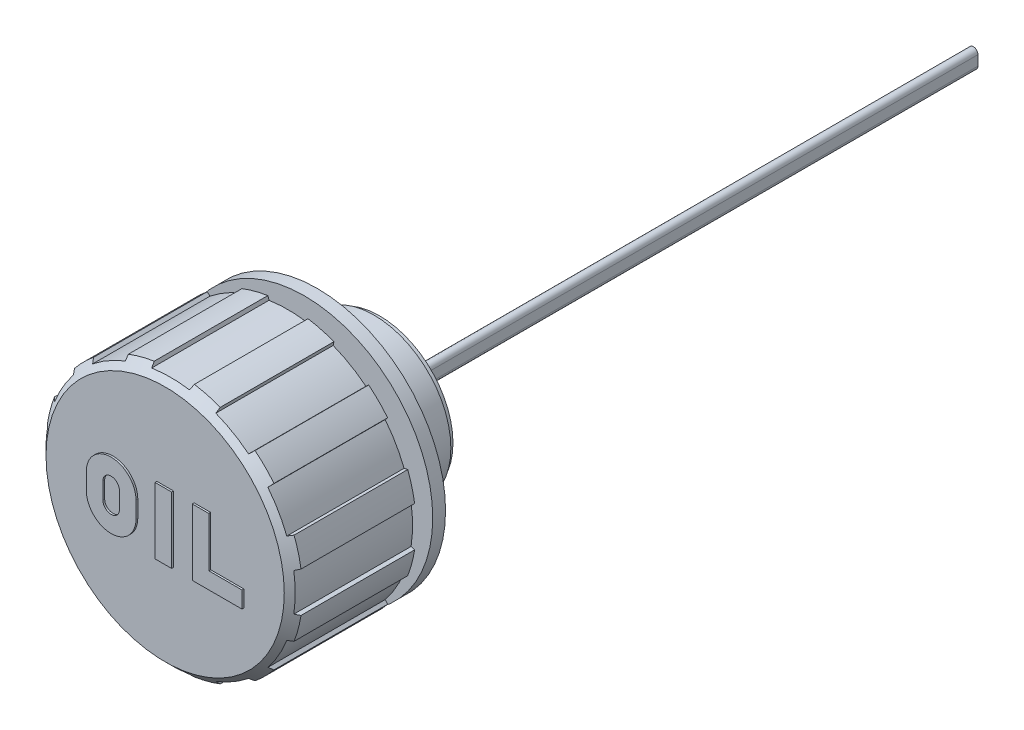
ISO-10303-21;
HEADER;
FILE_DESCRIPTION(('STEP AP214'),'2;1');
FILE_NAME('part.step','',(''),(''),'','','');
FILE_SCHEMA(('AUTOMOTIVE_DESIGN { 1 0 10303 214 1 1 1 1 }'));
ENDSEC;
DATA;
#1=APPLICATION_CONTEXT('core data for automotive mechanical design processes');
#2=APPLICATION_PROTOCOL_DEFINITION('international standard','automotive_design',2000,#1);
#3=PRODUCT_CONTEXT('',#1,'mechanical');
#4=PRODUCT('Part','Part','',(#3));
#5=PRODUCT_RELATED_PRODUCT_CATEGORY('part','',(#4));
#6=PRODUCT_DEFINITION_FORMATION('','',#4);
#7=PRODUCT_DEFINITION_CONTEXT('part definition',#1,'design');
#8=PRODUCT_DEFINITION('design','',#6,#7);
#9=PRODUCT_DEFINITION_SHAPE('','',#8);
#10=(LENGTH_UNIT() NAMED_UNIT(*) SI_UNIT(.MILLI.,.METRE.));
#11=(NAMED_UNIT(*) PLANE_ANGLE_UNIT() SI_UNIT($,.RADIAN.));
#12=(NAMED_UNIT(*) SI_UNIT($,.STERADIAN.) SOLID_ANGLE_UNIT());
#13=UNCERTAINTY_MEASURE_WITH_UNIT(LENGTH_MEASURE(1.E-05),#10,'distance_accuracy_value','');
#14=(GEOMETRIC_REPRESENTATION_CONTEXT(3) GLOBAL_UNCERTAINTY_ASSIGNED_CONTEXT((#13)) GLOBAL_UNIT_ASSIGNED_CONTEXT((#10,
#11,#12)) REPRESENTATION_CONTEXT('',''));
#15=CARTESIAN_POINT('',(0.,0.,0.));
#16=DIRECTION('',(0.,0.,1.));
#17=DIRECTION('',(1.,0.,0.));
#18=AXIS2_PLACEMENT_3D('',#15,#16,#17);
#19=CARTESIAN_POINT('',(0.,0.,7.25));
#20=DIRECTION('',(0.,0.,1.));
#21=DIRECTION('',(1.,0.,0.));
#22=AXIS2_PLACEMENT_3D('',#19,#20,#21);
#23=CYLINDRICAL_SURFACE('',#22,23.3333333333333);
#24=CARTESIAN_POINT('',(0.,0.,5.));
#25=DIRECTION('',(0.,0.,1.));
#26=DIRECTION('',(1.,0.,0.));
#27=AXIS2_PLACEMENT_3D('',#24,#25,#26);
#28=CIRCLE('',#27,23.3333333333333);
#29=CARTESIAN_POINT('',(23.3333333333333,0.,5.));
#30=VERTEX_POINT('',#29);
#31=EDGE_CURVE('E427',#30,#30,#28,.T.);
#32=ORIENTED_EDGE('',*,*,#31,.T.);
#33=EDGE_LOOP('',(#32));
#34=FACE_BOUND('',#33,.T.);
#35=CARTESIAN_POINT('',(0.,0.,9.5));
#36=DIRECTION('',(0.,0.,1.));
#37=DIRECTION('',(1.,0.,0.));
#38=AXIS2_PLACEMENT_3D('',#35,#36,#37);
#39=CIRCLE('',#38,23.3333333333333);
#40=CARTESIAN_POINT('',(23.3333333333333,0.,9.5));
#41=VERTEX_POINT('',#40);
#42=EDGE_CURVE('E423',#41,#41,#39,.T.);
#43=ORIENTED_EDGE('',*,*,#42,.F.);
#44=EDGE_LOOP('',(#43));
#45=FACE_BOUND('',#44,.T.);
#46=ADVANCED_FACE('F14',(#34,#45),#23,.T.);
#47=CARTESIAN_POINT('',(0.,29.1666666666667,5.));
#48=DIRECTION('',(0.,0.,1.));
#49=DIRECTION('',(1.,0.,0.));
#50=AXIS2_PLACEMENT_3D('',#47,#48,#49);
#51=PLANE('',#50);
#52=ORIENTED_EDGE('',*,*,#31,.F.);
#53=EDGE_LOOP('',(#52));
#54=FACE_BOUND('',#53,.T.);
#55=CARTESIAN_POINT('',(0.,0.,5.));
#56=DIRECTION('',(0.,0.,1.));
#57=DIRECTION('',(1.,0.,0.));
#58=AXIS2_PLACEMENT_3D('',#55,#56,#57);
#59=CIRCLE('',#58,35.);
#60=CARTESIAN_POINT('',(35.,0.,5.));
#61=VERTEX_POINT('',#60);
#62=EDGE_CURVE('E430',#61,#61,#59,.T.);
#63=ORIENTED_EDGE('',*,*,#62,.T.);
#64=EDGE_LOOP('',(#63));
#65=FACE_BOUND('',#64,.T.);
#66=ADVANCED_FACE('F1199',(#54,#65),#51,.T.);
#67=CARTESIAN_POINT('',(0.,0.,3.25));
#68=DIRECTION('',(0.,0.,1.));
#69=DIRECTION('',(1.,0.,0.));
#70=AXIS2_PLACEMENT_3D('',#67,#68,#69);
#71=CYLINDRICAL_SURFACE('',#70,35.);
#72=CARTESIAN_POINT('',(0.,0.,1.5));
#73=DIRECTION('',(0.,0.,1.));
#74=DIRECTION('',(1.,0.,0.));
#75=AXIS2_PLACEMENT_3D('',#72,#73,#74);
#76=CIRCLE('',#75,35.);
#77=CARTESIAN_POINT('',(35.,0.,1.5));
#78=VERTEX_POINT('',#77);
#79=EDGE_CURVE('E433',#78,#78,#76,.T.);
#80=ORIENTED_EDGE('',*,*,#79,.T.);
#81=EDGE_LOOP('',(#80));
#82=FACE_BOUND('',#81,.T.);
#83=ORIENTED_EDGE('',*,*,#62,.F.);
#84=EDGE_LOOP('',(#83));
#85=FACE_BOUND('',#84,.T.);
#86=ADVANCED_FACE('F1203',(#82,#85),#71,.T.);
#87=CARTESIAN_POINT('',(0.,33.4090909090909,1.5));
#88=DIRECTION('',(0.,0.,-1.));
#89=DIRECTION('',(-1.,0.,0.));
#90=AXIS2_PLACEMENT_3D('',#87,#88,#89);
#91=PLANE('',#90);
#92=ORIENTED_EDGE('',*,*,#79,.F.);
#93=EDGE_LOOP('',(#92));
#94=FACE_BOUND('',#93,.T.);
#95=CARTESIAN_POINT('',(0.,0.,1.5));
#96=DIRECTION('',(0.,0.,1.));
#97=DIRECTION('',(1.,0.,0.));
#98=AXIS2_PLACEMENT_3D('',#95,#96,#97);
#99=CIRCLE('',#98,31.8181818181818);
#100=CARTESIAN_POINT('',(31.8181818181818,0.,1.5));
#101=VERTEX_POINT('',#100);
#102=EDGE_CURVE('E436',#101,#101,#99,.T.);
#103=ORIENTED_EDGE('',*,*,#102,.T.);
#104=EDGE_LOOP('',(#103));
#105=FACE_BOUND('',#104,.T.);
#106=ADVANCED_FACE('F1207',(#94,#105),#91,.T.);
#107=CARTESIAN_POINT('',(0.,0.,0.75));
#108=DIRECTION('',(0.,0.,1.));
#109=DIRECTION('',(1.,0.,0.));
#110=AXIS2_PLACEMENT_3D('',#107,#108,#109);
#111=CYLINDRICAL_SURFACE('',#110,31.8181818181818);
#112=CARTESIAN_POINT('',(0.,0.,0.));
#113=DIRECTION('',(0.,0.,1.));
#114=DIRECTION('',(1.,0.,0.));
#115=AXIS2_PLACEMENT_3D('',#112,#113,#114);
#116=CIRCLE('',#115,31.8181818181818);
#117=CARTESIAN_POINT('',(31.8181818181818,0.,0.));
#118=VERTEX_POINT('',#117);
#119=EDGE_CURVE('E439',#118,#118,#116,.T.);
#120=ORIENTED_EDGE('',*,*,#119,.T.);
#121=EDGE_LOOP('',(#120));
#122=FACE_BOUND('',#121,.T.);
#123=ORIENTED_EDGE('',*,*,#102,.F.);
#124=EDGE_LOOP('',(#123));
#125=FACE_BOUND('',#124,.T.);
#126=ADVANCED_FACE('F1211',(#122,#125),#111,.T.);
#127=CARTESIAN_POINT('',(0.,26.3815909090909,0.));
#128=DIRECTION('',(0.,0.,-1.));
#129=DIRECTION('',(-1.,0.,0.));
#130=AXIS2_PLACEMENT_3D('',#127,#128,#129);
#131=PLANE('',#130);
#132=ORIENTED_EDGE('',*,*,#119,.F.);
#133=EDGE_LOOP('',(#132));
#134=FACE_BOUND('',#133,.T.);
#135=CARTESIAN_POINT('',(0.,0.,0.));
#136=DIRECTION('',(0.,0.,1.));
#137=DIRECTION('',(1.,0.,0.));
#138=AXIS2_PLACEMENT_3D('',#135,#136,#137);
#139=CIRCLE('',#138,20.945);
#140=CARTESIAN_POINT('',(20.945,0.,0.));
#141=VERTEX_POINT('',#140);
#142=EDGE_CURVE('E442',#141,#141,#139,.T.);
#143=ORIENTED_EDGE('',*,*,#142,.T.);
#144=EDGE_LOOP('',(#143));
#145=FACE_BOUND('',#144,.T.);
#146=ADVANCED_FACE('F1215',(#134,#145),#131,.T.);
#147=CARTESIAN_POINT('',(0.,0.,-7.));
#148=DIRECTION('',(0.,0.,1.));
#149=DIRECTION('',(1.,0.,0.));
#150=AXIS2_PLACEMENT_3D('',#147,#148,#149);
#151=CYLINDRICAL_SURFACE('',#150,20.945);
#152=CARTESIAN_POINT('',(0.,0.,-14.));
#153=DIRECTION('',(0.,0.,1.));
#154=DIRECTION('',(1.,0.,0.));
#155=AXIS2_PLACEMENT_3D('',#152,#153,#154);
#156=CIRCLE('',#155,20.945);
#157=CARTESIAN_POINT('',(20.945,0.,-14.));
#158=VERTEX_POINT('',#157);
#159=EDGE_CURVE('E445',#158,#158,#156,.T.);
#160=ORIENTED_EDGE('',*,*,#159,.T.);
#161=EDGE_LOOP('',(#160));
#162=FACE_BOUND('',#161,.T.);
#163=ORIENTED_EDGE('',*,*,#142,.F.);
#164=EDGE_LOOP('',(#163));
#165=FACE_BOUND('',#164,.T.);
#166=ADVANCED_FACE('F1219',(#162,#165),#151,.T.);
#167=CARTESIAN_POINT('',(0.,20.48492375,-14.));
#168=DIRECTION('',(0.,0.,-1.));
#169=DIRECTION('',(-1.,0.,0.));
#170=AXIS2_PLACEMENT_3D('',#167,#168,#169);
#171=PLANE('',#170);
#172=ORIENTED_EDGE('',*,*,#159,.F.);
#173=EDGE_LOOP('',(#172));
#174=FACE_BOUND('',#173,.T.);
#175=CARTESIAN_POINT('',(0.,0.,-14.));
#176=DIRECTION('',(0.,0.,1.));
#177=DIRECTION('',(1.,0.,0.));
#178=AXIS2_PLACEMENT_3D('',#175,#176,#177);
#179=CIRCLE('',#178,20.0248475);
#180=CARTESIAN_POINT('',(20.0248475,0.,-14.));
#181=VERTEX_POINT('',#180);
#182=EDGE_CURVE('E448',#181,#181,#179,.T.);
#183=ORIENTED_EDGE('',*,*,#182,.T.);
#184=EDGE_LOOP('',(#183));
#185=FACE_BOUND('',#184,.T.);
#186=ADVANCED_FACE('F1223',(#174,#185),#171,.T.);
#187=CARTESIAN_POINT('',(0.,0.,-14.75));
#188=DIRECTION('',(0.,0.,1.));
#189=DIRECTION('',(1.,0.,0.));
#190=AXIS2_PLACEMENT_3D('',#187,#188,#189);
#191=CYLINDRICAL_SURFACE('',#190,20.0248475);
#192=CARTESIAN_POINT('',(0.,0.,-15.5));
#193=DIRECTION('',(0.,0.,1.));
#194=DIRECTION('',(1.,0.,0.));
#195=AXIS2_PLACEMENT_3D('',#192,#193,#194);
#196=CIRCLE('',#195,20.0248475);
#197=CARTESIAN_POINT('',(20.0248475,0.,-15.5));
#198=VERTEX_POINT('',#197);
#199=EDGE_CURVE('E451',#198,#198,#196,.T.);
#200=ORIENTED_EDGE('',*,*,#199,.T.);
#201=EDGE_LOOP('',(#200));
#202=FACE_BOUND('',#201,.T.);
#203=ORIENTED_EDGE('',*,*,#182,.F.);
#204=EDGE_LOOP('',(#203));
#205=FACE_BOUND('',#204,.T.);
#206=ADVANCED_FACE('F1227',(#202,#205),#191,.T.);
#207=CARTESIAN_POINT('',(0.,15.76242375,-15.5));
#208=DIRECTION('',(0.,0.,-1.));
#209=DIRECTION('',(-1.,0.,0.));
#210=AXIS2_PLACEMENT_3D('',#207,#208,#209);
#211=PLANE('',#210);
#212=ORIENTED_EDGE('',*,*,#199,.F.);
#213=EDGE_LOOP('',(#212));
#214=FACE_BOUND('',#213,.T.);
#215=CARTESIAN_POINT('',(0.,0.,-15.5));
#216=DIRECTION('',(0.,0.,1.));
#217=DIRECTION('',(1.,0.,0.));
#218=AXIS2_PLACEMENT_3D('',#215,#216,#217);
#219=CIRCLE('',#218,11.5);
#220=CARTESIAN_POINT('',(11.5,0.,-15.5));
#221=VERTEX_POINT('',#220);
#222=EDGE_CURVE('E454',#221,#221,#219,.T.);
#223=ORIENTED_EDGE('',*,*,#222,.T.);
#224=EDGE_LOOP('',(#223));
#225=FACE_BOUND('',#224,.T.);
#226=ADVANCED_FACE('F1231',(#214,#225),#211,.T.);
#227=CARTESIAN_POINT('',(0.,0.,-5.25));
#228=DIRECTION('',(0.,0.,1.));
#229=DIRECTION('',(1.,0.,0.));
#230=AXIS2_PLACEMENT_3D('',#227,#228,#229);
#231=CYLINDRICAL_SURFACE('',#230,11.5);
#232=CARTESIAN_POINT('',(0.,0.,5.));
#233=DIRECTION('',(0.,0.,1.));
#234=DIRECTION('',(1.,0.,0.));
#235=AXIS2_PLACEMENT_3D('',#232,#233,#234);
#236=CIRCLE('',#235,11.5);
#237=CARTESIAN_POINT('',(11.5,0.,5.));
#238=VERTEX_POINT('',#237);
#239=EDGE_CURVE('E457',#238,#238,#236,.F.);
#240=ORIENTED_EDGE('',*,*,#239,.F.);
#241=EDGE_LOOP('',(#240));
#242=FACE_BOUND('',#241,.T.);
#243=ORIENTED_EDGE('',*,*,#222,.F.);
#244=EDGE_LOOP('',(#243));
#245=FACE_BOUND('',#244,.T.);
#246=ADVANCED_FACE('F1235',(#242,#245),#231,.F.);
#247=CARTESIAN_POINT('',(0.,5.75,5.));
#248=DIRECTION('',(0.,0.,-1.));
#249=DIRECTION('',(-1.,0.,0.));
#250=AXIS2_PLACEMENT_3D('',#247,#248,#249);
#251=PLANE('',#250);
#252=ORIENTED_EDGE('',*,*,#239,.T.);
#253=EDGE_LOOP('',(#252));
#254=FACE_BOUND('',#253,.T.);
#255=CARTESIAN_POINT('',(0.,1.35,5.));
#256=DIRECTION('',(0.,0.,1.));
#257=DIRECTION('',(1.,0.,0.));
#258=AXIS2_PLACEMENT_3D('',#255,#256,#257);
#259=CIRCLE('',#258,1.25);
#260=CARTESIAN_POINT('',(1.25,1.35,5.));
#261=VERTEX_POINT('',#260);
#262=CARTESIAN_POINT('',(-1.25,1.35,5.));
#263=VERTEX_POINT('',#262);
#264=EDGE_CURVE('E461',#261,#263,#259,.T.);
#265=ORIENTED_EDGE('',*,*,#264,.T.);
#266=DIRECTION('',(0.,1.,0.));
#267=VECTOR('',#266,1.);
#268=CARTESIAN_POINT('',(-1.25,5.75,5.));
#269=LINE('',#268,#267);
#270=CARTESIAN_POINT('',(-1.25,-1.35,5.));
#271=VERTEX_POINT('',#270);
#272=EDGE_CURVE('E460',#263,#271,#269,.F.);
#273=ORIENTED_EDGE('',*,*,#272,.T.);
#274=CARTESIAN_POINT('',(0.,-1.35,5.));
#275=DIRECTION('',(0.,0.,1.));
#276=DIRECTION('',(1.,0.,0.));
#277=AXIS2_PLACEMENT_3D('',#274,#275,#276);
#278=CIRCLE('',#277,1.25);
#279=CARTESIAN_POINT('',(1.25,-1.35,5.));
#280=VERTEX_POINT('',#279);
#281=EDGE_CURVE('E408',#271,#280,#278,.T.);
#282=ORIENTED_EDGE('',*,*,#281,.T.);
#283=DIRECTION('',(0.,1.,0.));
#284=VECTOR('',#283,1.);
#285=CARTESIAN_POINT('',(1.25,5.75,5.));
#286=LINE('',#285,#284);
#287=EDGE_CURVE('E464',#280,#261,#286,.T.);
#288=ORIENTED_EDGE('',*,*,#287,.T.);
#289=EDGE_LOOP('',(#265,#273,#282,#288));
#290=FACE_BOUND('',#289,.T.);
#291=ADVANCED_FACE('F1239',(#254,#290),#251,.T.);
#292=CARTESIAN_POINT('',(0.,1.35,18.5));
#293=DIRECTION('',(0.,0.,1.));
#294=DIRECTION('',(1.,0.,0.));
#295=AXIS2_PLACEMENT_3D('',#292,#293,#294);
#296=CYLINDRICAL_SURFACE('',#295,1.25);
#297=CARTESIAN_POINT('',(0.,1.35,-177.5));
#298=DIRECTION('',(0.,0.,1.));
#299=DIRECTION('',(1.,0.,0.));
#300=AXIS2_PLACEMENT_3D('',#297,#298,#299);
#301=CIRCLE('',#300,1.25);
#302=CARTESIAN_POINT('',(1.25,1.35,-177.5));
#303=VERTEX_POINT('',#302);
#304=CARTESIAN_POINT('',(-1.25,1.35,-177.5));
#305=VERTEX_POINT('',#304);
#306=EDGE_CURVE('E416',#303,#305,#301,.T.);
#307=ORIENTED_EDGE('',*,*,#306,.T.);
#308=DIRECTION('',(0.,0.,1.));
#309=VECTOR('',#308,1.);
#310=CARTESIAN_POINT('',(-1.25,1.35,18.5));
#311=LINE('',#310,#309);
#312=EDGE_CURVE('E414',#263,#305,#311,.F.);
#313=ORIENTED_EDGE('',*,*,#312,.F.);
#314=ORIENTED_EDGE('',*,*,#264,.F.);
#315=DIRECTION('',(0.,0.,1.));
#316=VECTOR('',#315,1.);
#317=CARTESIAN_POINT('',(1.25,1.35,18.5));
#318=LINE('',#317,#316);
#319=EDGE_CURVE('E422',#261,#303,#318,.F.);
#320=ORIENTED_EDGE('',*,*,#319,.T.);
#321=EDGE_LOOP('',(#307,#313,#314,#320));
#322=FACE_BOUND('',#321,.T.);
#323=ADVANCED_FACE('F1243',(#322),#296,.T.);
#324=CARTESIAN_POINT('',(-1.25,1.35,18.5));
#325=DIRECTION('',(-1.,0.,0.));
#326=DIRECTION('',(0.,0.,1.));
#327=AXIS2_PLACEMENT_3D('',#324,#325,#326);
#328=PLANE('',#327);
#329=DIRECTION('',(0.,1.,0.));
#330=VECTOR('',#329,1.);
#331=CARTESIAN_POINT('',(-1.25,1.35,-177.5));
#332=LINE('',#331,#330);
#333=CARTESIAN_POINT('',(-1.25,-1.35,-177.5));
#334=VERTEX_POINT('',#333);
#335=EDGE_CURVE('E398',#305,#334,#332,.F.);
#336=ORIENTED_EDGE('',*,*,#335,.T.);
#337=DIRECTION('',(0.,0.,1.));
#338=VECTOR('',#337,1.);
#339=CARTESIAN_POINT('',(-1.25,-1.35,18.5));
#340=LINE('',#339,#338);
#341=EDGE_CURVE('E405',#334,#271,#340,.T.);
#342=ORIENTED_EDGE('',*,*,#341,.T.);
#343=ORIENTED_EDGE('',*,*,#272,.F.);
#344=ORIENTED_EDGE('',*,*,#312,.T.);
#345=EDGE_LOOP('',(#336,#342,#343,#344));
#346=FACE_BOUND('',#345,.T.);
#347=ADVANCED_FACE('F413',(#346),#328,.T.);
#348=CARTESIAN_POINT('',(0.,-1.35,18.5));
#349=DIRECTION('',(0.,0.,1.));
#350=DIRECTION('',(1.,0.,0.));
#351=AXIS2_PLACEMENT_3D('',#348,#349,#350);
#352=CYLINDRICAL_SURFACE('',#351,1.25);
#353=CARTESIAN_POINT('',(0.,-1.35,-177.5));
#354=DIRECTION('',(0.,0.,1.));
#355=DIRECTION('',(1.,0.,0.));
#356=AXIS2_PLACEMENT_3D('',#353,#354,#355);
#357=CIRCLE('',#356,1.25);
#358=CARTESIAN_POINT('',(1.25,-1.35,-177.5));
#359=VERTEX_POINT('',#358);
#360=EDGE_CURVE('E18',#334,#359,#357,.T.);
#361=ORIENTED_EDGE('',*,*,#360,.T.);
#362=DIRECTION('',(0.,0.,-1.));
#363=VECTOR('',#362,1.);
#364=CARTESIAN_POINT('',(1.25,-1.35,18.5));
#365=LINE('',#364,#363);
#366=EDGE_CURVE('E403',#280,#359,#365,.T.);
#367=ORIENTED_EDGE('',*,*,#366,.F.);
#368=ORIENTED_EDGE('',*,*,#281,.F.);
#369=ORIENTED_EDGE('',*,*,#341,.F.);
#370=EDGE_LOOP('',(#361,#367,#368,#369));
#371=FACE_BOUND('',#370,.T.);
#372=ADVANCED_FACE('F406',(#371),#352,.T.);
#373=CARTESIAN_POINT('',(1.25,-1.35,18.5));
#374=DIRECTION('',(1.,0.,0.));
#375=DIRECTION('',(0.,0.,-1.));
#376=AXIS2_PLACEMENT_3D('',#373,#374,#375);
#377=PLANE('',#376);
#378=DIRECTION('',(0.,1.,0.));
#379=VECTOR('',#378,1.);
#380=CARTESIAN_POINT('',(1.25,-1.35,-177.5));
#381=LINE('',#380,#379);
#382=EDGE_CURVE('E400',#359,#303,#381,.T.);
#383=ORIENTED_EDGE('',*,*,#382,.T.);
#384=ORIENTED_EDGE('',*,*,#319,.F.);
#385=ORIENTED_EDGE('',*,*,#287,.F.);
#386=ORIENTED_EDGE('',*,*,#366,.T.);
#387=EDGE_LOOP('',(#383,#384,#385,#386));
#388=FACE_BOUND('',#387,.T.);
#389=ADVANCED_FACE('F1249',(#388),#377,.T.);
#390=CARTESIAN_POINT('',(0.,0.,-177.5));
#391=DIRECTION('',(0.,0.,1.));
#392=DIRECTION('',(1.,0.,0.));
#393=AXIS2_PLACEMENT_3D('',#390,#391,#392);
#394=PLANE('',#393);
#395=ORIENTED_EDGE('',*,*,#335,.F.);
#396=ORIENTED_EDGE('',*,*,#306,.F.);
#397=ORIENTED_EDGE('',*,*,#382,.F.);
#398=ORIENTED_EDGE('',*,*,#360,.F.);
#399=EDGE_LOOP('',(#395,#396,#397,#398));
#400=FACE_BOUND('',#399,.T.);
#401=ADVANCED_FACE('F16',(#400),#394,.F.);
#402=CARTESIAN_POINT('',(0.,32.5,9.5));
#403=DIRECTION('',(0.,0.,-1.));
#404=DIRECTION('',(-1.,0.,0.));
#405=AXIS2_PLACEMENT_3D('',#402,#403,#404);
#406=PLANE('',#405);
#407=DIRECTION('',(-0.951056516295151,0.309016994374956,0.));
#408=VECTOR('',#407,1.);
#409=CARTESIAN_POINT('',(-33.6058248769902,5.16222184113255,9.5));
#410=LINE('',#409,#408);
#411=CARTESIAN_POINT('',(-33.6058248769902,5.16222184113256,9.5));
#412=VERTEX_POINT('',#411);
#413=CARTESIAN_POINT('',(-34.5690919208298,5.47520627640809,9.5));
#414=VERTEX_POINT('',#413);
#415=EDGE_CURVE('E923',#412,#414,#410,.T.);
#416=ORIENTED_EDGE('',*,*,#415,.T.);
#417=CARTESIAN_POINT('',(6.11066752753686E-13,-1.04805053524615E-13,9.5));
#418=DIRECTION('',(0.,0.,1.));
#419=DIRECTION('',(1.,0.,0.));
#420=AXIS2_PLACEMENT_3D('',#417,#418,#419);
#421=CIRCLE('',#420,35.0000000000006);
#422=CARTESIAN_POINT('',(-32.6753149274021,12.5428782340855,9.5));
#423=VERTEX_POINT('',#422);
#424=EDGE_CURVE('E836',#423,#414,#421,.T.);
#425=ORIENTED_EDGE('',*,*,#424,.F.);
#426=DIRECTION('',(0.978147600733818,-0.207911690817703,0.));
#427=VECTOR('',#426,1.);
#428=CARTESIAN_POINT('',(-32.6753149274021,12.5428782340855,9.5));
#429=LINE('',#428,#427);
#430=CARTESIAN_POINT('',(-31.6846089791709,12.3322971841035,9.5));
#431=VERTEX_POINT('',#430);
#432=EDGE_CURVE('E974',#423,#431,#429,.T.);
#433=ORIENTED_EDGE('',*,*,#432,.T.);
#434=CARTESIAN_POINT('',(2.1316282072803E-13,-1.91846538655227E-13,9.5));
#435=DIRECTION('',(0.,0.,1.));
#436=DIRECTION('',(1.,0.,0.));
#437=AXIS2_PLACEMENT_3D('',#434,#435,#436);
#438=CIRCLE('',#437,34.);
#439=CARTESIAN_POINT('',(-26.5223871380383,21.2735276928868,9.5));
#440=VERTEX_POINT('',#439);
#441=EDGE_CURVE('E841',#440,#431,#438,.T.);
#442=ORIENTED_EDGE('',*,*,#441,.F.);
#443=DIRECTION('',(-0.669130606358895,0.743144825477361,0.));
#444=VECTOR('',#443,1.);
#445=CARTESIAN_POINT('',(-26.5223871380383,21.2735276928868,9.5));
#446=LINE('',#445,#444);
#447=CARTESIAN_POINT('',(-27.200108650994,22.0262136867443,9.5));
#448=VERTEX_POINT('',#447);
#449=EDGE_CURVE('E972',#440,#448,#446,.T.);
#450=ORIENTED_EDGE('',*,*,#449,.T.);
#451=CARTESIAN_POINT('',(1.52766688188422E-13,-3.12638803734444E-13,9.5));
#452=DIRECTION('',(0.,0.,1.));
#453=DIRECTION('',(1.,0.,0.));
#454=AXIS2_PLACEMENT_3D('',#451,#452,#453);
#455=CIRCLE('',#454,35.);
#456=CARTESIAN_POINT('',(-22.0262136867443,27.200108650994,9.5));
#457=VERTEX_POINT('',#456);
#458=EDGE_CURVE('E846',#457,#448,#455,.T.);
#459=ORIENTED_EDGE('',*,*,#458,.F.);
#460=DIRECTION('',(0.743144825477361,-0.669130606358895,0.));
#461=VECTOR('',#460,1.);
#462=CARTESIAN_POINT('',(-22.0262136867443,27.200108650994,9.5));
#463=LINE('',#462,#461);
#464=CARTESIAN_POINT('',(-21.2735276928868,26.5223871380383,9.5));
#465=VERTEX_POINT('',#464);
#466=EDGE_CURVE('E970',#457,#465,#463,.T.);
#467=ORIENTED_EDGE('',*,*,#466,.T.);
#468=CARTESIAN_POINT('',(0.,-1.4210854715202E-13,9.5));
#469=DIRECTION('',(0.,0.,1.));
#470=DIRECTION('',(1.,0.,0.));
#471=AXIS2_PLACEMENT_3D('',#468,#469,#470);
#472=CIRCLE('',#471,34.);
#473=CARTESIAN_POINT('',(-12.3322971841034,31.6846089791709,9.5));
#474=VERTEX_POINT('',#473);
#475=EDGE_CURVE('E851',#474,#465,#472,.T.);
#476=ORIENTED_EDGE('',*,*,#475,.F.);
#477=DIRECTION('',(-0.207911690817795,0.978147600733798,0.));
#478=VECTOR('',#477,1.);
#479=CARTESIAN_POINT('',(-12.3322971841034,31.6846089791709,9.5));
#480=LINE('',#479,#478);
#481=CARTESIAN_POINT('',(-12.5428782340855,32.6753149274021,9.5));
#482=VERTEX_POINT('',#481);
#483=EDGE_CURVE('E968',#474,#482,#480,.T.);
#484=ORIENTED_EDGE('',*,*,#483,.T.);
#485=CARTESIAN_POINT('',(1.58095758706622E-13,-1.62003743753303E-12,9.5));
#486=DIRECTION('',(0.,0.,1.));
#487=DIRECTION('',(1.,0.,0.));
#488=AXIS2_PLACEMENT_3D('',#485,#486,#487);
#489=CIRCLE('',#488,35.0000000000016);
#490=CARTESIAN_POINT('',(-5.47520627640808,34.5690919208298,9.5));
#491=VERTEX_POINT('',#490);
#492=EDGE_CURVE('E856',#491,#482,#489,.T.);
#493=ORIENTED_EDGE('',*,*,#492,.F.);
#494=DIRECTION('',(0.309016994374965,-0.951056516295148,0.));
#495=VECTOR('',#494,1.);
#496=CARTESIAN_POINT('',(-5.47520627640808,34.5690919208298,9.5));
#497=LINE('',#496,#495);
#498=CARTESIAN_POINT('',(-5.16222184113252,33.6058248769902,9.5));
#499=VERTEX_POINT('',#498);
#500=EDGE_CURVE('E966',#491,#499,#497,.T.);
#501=ORIENTED_EDGE('',*,*,#500,.T.);
#502=CARTESIAN_POINT('',(1.54543045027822E-13,2.34479102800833E-13,9.5));
#503=DIRECTION('',(0.,0.,1.));
#504=DIRECTION('',(1.,0.,0.));
#505=AXIS2_PLACEMENT_3D('',#502,#503,#504);
#506=CIRCLE('',#505,34.);
#507=CARTESIAN_POINT('',(5.16222184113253,33.6058248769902,9.5));
#508=VERTEX_POINT('',#507);
#509=EDGE_CURVE('E861',#508,#499,#506,.T.);
#510=ORIENTED_EDGE('',*,*,#509,.F.);
#511=DIRECTION('',(0.309016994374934,0.951056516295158,0.));
#512=VECTOR('',#511,1.);
#513=CARTESIAN_POINT('',(5.16222184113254,33.6058248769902,9.5));
#514=LINE('',#513,#512);
#515=CARTESIAN_POINT('',(5.47520627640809,34.5690919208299,9.5));
#516=VERTEX_POINT('',#515);
#517=EDGE_CURVE('E964',#508,#516,#514,.T.);
#518=ORIENTED_EDGE('',*,*,#517,.T.);
#519=CARTESIAN_POINT('',(-5.04485342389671E-13,-1.04449782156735E-12,9.5));
#520=DIRECTION('',(0.,0.,1.));
#521=DIRECTION('',(1.,0.,0.));
#522=AXIS2_PLACEMENT_3D('',#519,#520,#521);
#523=CIRCLE('',#522,35.0000000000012);
#524=CARTESIAN_POINT('',(12.5428782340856,32.6753149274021,9.5));
#525=VERTEX_POINT('',#524);
#526=EDGE_CURVE('E866',#525,#516,#523,.T.);
#527=ORIENTED_EDGE('',*,*,#526,.F.);
#528=DIRECTION('',(-0.207911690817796,-0.978147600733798,0.));
#529=VECTOR('',#528,1.);
#530=CARTESIAN_POINT('',(12.5428782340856,32.675314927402,9.5));
#531=LINE('',#530,#529);
#532=CARTESIAN_POINT('',(12.3322971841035,31.6846089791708,9.5));
#533=VERTEX_POINT('',#532);
#534=EDGE_CURVE('E962',#525,#533,#531,.T.);
#535=ORIENTED_EDGE('',*,*,#534,.T.);
#536=CARTESIAN_POINT('',(4.72510919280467E-13,4.72510919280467E-13,9.5));
#537=DIRECTION('',(0.,0.,1.));
#538=DIRECTION('',(1.,0.,0.));
#539=AXIS2_PLACEMENT_3D('',#536,#537,#538);
#540=CIRCLE('',#539,33.9999999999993);
#541=CARTESIAN_POINT('',(21.2735276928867,26.5223871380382,9.5));
#542=VERTEX_POINT('',#541);
#543=EDGE_CURVE('E871',#542,#533,#540,.T.);
#544=ORIENTED_EDGE('',*,*,#543,.F.);
#545=DIRECTION('',(0.743144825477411,0.66913060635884,0.));
#546=VECTOR('',#545,1.);
#547=CARTESIAN_POINT('',(21.2735276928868,26.5223871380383,9.5));
#548=LINE('',#547,#546);
#549=CARTESIAN_POINT('',(22.0262136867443,27.2001086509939,9.5));
#550=VERTEX_POINT('',#549);
#551=EDGE_CURVE('E960',#542,#550,#548,.T.);
#552=ORIENTED_EDGE('',*,*,#551,.T.);
#553=CARTESIAN_POINT('',(6.60804744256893E-13,5.61328761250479E-13,9.5));
#554=DIRECTION('',(0.,0.,1.));
#555=DIRECTION('',(1.,0.,0.));
#556=AXIS2_PLACEMENT_3D('',#553,#554,#555);
#557=CIRCLE('',#556,34.9999999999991);
#558=CARTESIAN_POINT('',(27.200108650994,22.0262136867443,9.5));
#559=VERTEX_POINT('',#558);
#560=EDGE_CURVE('E876',#559,#550,#557,.T.);
#561=ORIENTED_EDGE('',*,*,#560,.F.);
#562=DIRECTION('',(-0.669130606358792,-0.743144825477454,0.));
#563=VECTOR('',#562,1.);
#564=CARTESIAN_POINT('',(27.200108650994,22.0262136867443,9.5));
#565=LINE('',#564,#563);
#566=CARTESIAN_POINT('',(26.5223871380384,21.2735276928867,9.5));
#567=VERTEX_POINT('',#566);
#568=EDGE_CURVE('E958',#559,#567,#565,.T.);
#569=ORIENTED_EDGE('',*,*,#568,.T.);
#570=CARTESIAN_POINT('',(0.,0.,9.5));
#571=DIRECTION('',(0.,0.,1.));
#572=DIRECTION('',(1.,0.,0.));
#573=AXIS2_PLACEMENT_3D('',#570,#571,#572);
#574=CIRCLE('',#573,34.);
#575=CARTESIAN_POINT('',(31.6846089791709,12.3322971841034,9.5));
#576=VERTEX_POINT('',#575);
#577=EDGE_CURVE('E881',#576,#567,#574,.T.);
#578=ORIENTED_EDGE('',*,*,#577,.F.);
#579=DIRECTION('',(0.978147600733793,0.207911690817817,0.));
#580=VECTOR('',#579,1.);
#581=CARTESIAN_POINT('',(31.6846089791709,12.3322971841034,9.5));
#582=LINE('',#581,#580);
#583=CARTESIAN_POINT('',(32.675314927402,12.5428782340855,9.5));
#584=VERTEX_POINT('',#583);
#585=EDGE_CURVE('E956',#576,#584,#582,.T.);
#586=ORIENTED_EDGE('',*,*,#585,.T.);
#587=CARTESIAN_POINT('',(1.442401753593E-12,2.17603712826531E-13,9.5));
#588=DIRECTION('',(0.,0.,1.));
#589=DIRECTION('',(1.,0.,0.));
#590=AXIS2_PLACEMENT_3D('',#587,#588,#589);
#591=CIRCLE('',#590,34.9999999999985);
#592=CARTESIAN_POINT('',(34.5690919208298,5.47520627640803,9.5));
#593=VERTEX_POINT('',#592);
#594=EDGE_CURVE('E886',#593,#584,#591,.T.);
#595=ORIENTED_EDGE('',*,*,#594,.F.);
#596=DIRECTION('',(-0.951056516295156,-0.30901699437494,0.));
#597=VECTOR('',#596,1.);
#598=CARTESIAN_POINT('',(34.5690919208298,5.47520627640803,9.5));
#599=LINE('',#598,#597);
#600=CARTESIAN_POINT('',(33.6058248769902,5.16222184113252,9.5));
#601=VERTEX_POINT('',#600);
#602=EDGE_CURVE('E954',#593,#601,#599,.T.);
#603=ORIENTED_EDGE('',*,*,#602,.T.);
#604=CARTESIAN_POINT('',(2.41584530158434E-13,0.,9.5));
#605=DIRECTION('',(0.,0.,1.));
#606=DIRECTION('',(1.,0.,0.));
#607=AXIS2_PLACEMENT_3D('',#604,#605,#606);
#608=CIRCLE('',#607,34.);
#609=CARTESIAN_POINT('',(33.6058248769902,-5.16222184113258,9.5));
#610=VERTEX_POINT('',#609);
#611=EDGE_CURVE('E891',#610,#601,#608,.T.);
#612=ORIENTED_EDGE('',*,*,#611,.F.);
#613=DIRECTION('',(0.951056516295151,-0.309016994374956,0.));
#614=VECTOR('',#613,1.);
#615=CARTESIAN_POINT('',(33.6058248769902,-5.16222184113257,9.5));
#616=LINE('',#615,#614);
#617=CARTESIAN_POINT('',(34.5690919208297,-5.47520627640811,9.5));
#618=VERTEX_POINT('',#617);
#619=EDGE_CURVE('E952',#610,#618,#616,.T.);
#620=ORIENTED_EDGE('',*,*,#619,.T.);
#621=CARTESIAN_POINT('',(-3.69482222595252E-13,0.,9.5));
#622=DIRECTION('',(0.,0.,1.));
#623=DIRECTION('',(1.,0.,0.));
#624=AXIS2_PLACEMENT_3D('',#621,#622,#623);
#625=CIRCLE('',#624,35.);
#626=CARTESIAN_POINT('',(32.675314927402,-12.5428782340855,9.5));
#627=VERTEX_POINT('',#626);
#628=EDGE_CURVE('E896',#627,#618,#625,.T.);
#629=ORIENTED_EDGE('',*,*,#628,.F.);
#630=DIRECTION('',(-0.978147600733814,0.207911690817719,0.));
#631=VECTOR('',#630,1.);
#632=CARTESIAN_POINT('',(32.675314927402,-12.5428782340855,9.5));
#633=LINE('',#632,#631);
#634=CARTESIAN_POINT('',(31.6846089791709,-12.3322971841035,9.5));
#635=VERTEX_POINT('',#634);
#636=EDGE_CURVE('E950',#627,#635,#633,.T.);
#637=ORIENTED_EDGE('',*,*,#636,.T.);
#638=CARTESIAN_POINT('',(-3.23296944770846E-13,3.01980662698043E-13,9.5));
#639=DIRECTION('',(0.,0.,1.));
#640=DIRECTION('',(1.,0.,0.));
#641=AXIS2_PLACEMENT_3D('',#638,#639,#640);
#642=CIRCLE('',#641,34.0000000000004);
#643=CARTESIAN_POINT('',(26.5223871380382,-21.2735276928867,9.5));
#644=VERTEX_POINT('',#643);
#645=EDGE_CURVE('E901',#644,#635,#642,.T.);
#646=ORIENTED_EDGE('',*,*,#645,.F.);
#647=DIRECTION('',(0.669130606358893,-0.743144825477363,0.));
#648=VECTOR('',#647,1.);
#649=CARTESIAN_POINT('',(26.5223871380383,-21.2735276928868,9.5));
#650=LINE('',#649,#648);
#651=CARTESIAN_POINT('',(27.200108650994,-22.0262136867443,9.5));
#652=VERTEX_POINT('',#651);
#653=EDGE_CURVE('E948',#644,#652,#650,.T.);
#654=ORIENTED_EDGE('',*,*,#653,.T.);
#655=CARTESIAN_POINT('',(9.02389274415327E-13,-8.10018718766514E-13,9.5));
#656=DIRECTION('',(0.,0.,1.));
#657=DIRECTION('',(1.,0.,0.));
#658=AXIS2_PLACEMENT_3D('',#655,#656,#657);
#659=CIRCLE('',#658,34.9999999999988);
#660=CARTESIAN_POINT('',(22.0262136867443,-27.200108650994,9.5));
#661=VERTEX_POINT('',#660);
#662=EDGE_CURVE('E744',#661,#652,#659,.T.);
#663=ORIENTED_EDGE('',*,*,#662,.F.);
#664=DIRECTION('',(-0.743144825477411,0.66913060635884,0.));
#665=VECTOR('',#664,1.);
#666=CARTESIAN_POINT('',(22.0262136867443,-27.200108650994,9.5));
#667=LINE('',#666,#665);
#668=CARTESIAN_POINT('',(21.2735276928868,-26.5223871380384,9.5));
#669=VERTEX_POINT('',#668);
#670=EDGE_CURVE('E740',#661,#669,#667,.T.);
#671=ORIENTED_EDGE('',*,*,#670,.T.);
#672=CARTESIAN_POINT('',(0.,2.70006239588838E-13,9.5));
#673=DIRECTION('',(0.,0.,1.));
#674=DIRECTION('',(1.,0.,0.));
#675=AXIS2_PLACEMENT_3D('',#672,#673,#674);
#676=CIRCLE('',#675,34.);
#677=CARTESIAN_POINT('',(12.3322971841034,-31.6846089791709,9.5));
#678=VERTEX_POINT('',#677);
#679=EDGE_CURVE('E762',#678,#669,#676,.T.);
#680=ORIENTED_EDGE('',*,*,#679,.F.);
#681=DIRECTION('',(0.207911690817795,-0.978147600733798,0.));
#682=VECTOR('',#681,1.);
#683=CARTESIAN_POINT('',(12.3322971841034,-31.6846089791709,9.5));
#684=LINE('',#683,#682);
#685=CARTESIAN_POINT('',(12.5428782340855,-32.6753149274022,9.5));
#686=VERTEX_POINT('',#685);
#687=EDGE_CURVE('E945',#678,#686,#684,.T.);
#688=ORIENTED_EDGE('',*,*,#687,.T.);
#689=CARTESIAN_POINT('',(0.,8.81072992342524E-13,9.5));
#690=DIRECTION('',(0.,0.,1.));
#691=DIRECTION('',(1.,0.,0.));
#692=AXIS2_PLACEMENT_3D('',#689,#690,#691);
#693=CIRCLE('',#692,35.0000000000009);
#694=CARTESIAN_POINT('',(5.47520627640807,-34.5690919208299,9.5));
#695=VERTEX_POINT('',#694);
#696=EDGE_CURVE('E768',#695,#686,#693,.T.);
#697=ORIENTED_EDGE('',*,*,#696,.F.);
#698=DIRECTION('',(-0.309016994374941,0.951056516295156,0.));
#699=VECTOR('',#698,1.);
#700=CARTESIAN_POINT('',(5.47520627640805,-34.5690919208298,9.5));
#701=LINE('',#700,#699);
#702=CARTESIAN_POINT('',(5.16222184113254,-33.6058248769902,9.5));
#703=VERTEX_POINT('',#702);
#704=EDGE_CURVE('E920',#695,#703,#701,.T.);
#705=ORIENTED_EDGE('',*,*,#704,.T.);
#706=CARTESIAN_POINT('',(0.,-2.34479102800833E-13,9.5));
#707=DIRECTION('',(0.,0.,1.));
#708=DIRECTION('',(1.,0.,0.));
#709=AXIS2_PLACEMENT_3D('',#706,#707,#708);
#710=CIRCLE('',#709,34.);
#711=CARTESIAN_POINT('',(-5.16222184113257,-33.6058248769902,9.5));
#712=VERTEX_POINT('',#711);
#713=EDGE_CURVE('E801',#712,#703,#710,.T.);
#714=ORIENTED_EDGE('',*,*,#713,.F.);
#715=DIRECTION('',(-0.309016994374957,-0.95105651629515,0.));
#716=VECTOR('',#715,1.);
#717=CARTESIAN_POINT('',(-5.16222184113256,-33.6058248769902,9.5));
#718=LINE('',#717,#716);
#719=CARTESIAN_POINT('',(-5.47520627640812,-34.5690919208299,9.5));
#720=VERTEX_POINT('',#719);
#721=EDGE_CURVE('E943',#712,#720,#718,.T.);
#722=ORIENTED_EDGE('',*,*,#721,.T.);
#723=CARTESIAN_POINT('',(2.8066438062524E-13,1.55608859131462E-12,9.5));
#724=DIRECTION('',(0.,0.,1.));
#725=DIRECTION('',(1.,0.,0.));
#726=AXIS2_PLACEMENT_3D('',#723,#724,#725);
#727=CIRCLE('',#726,35.0000000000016);
#728=CARTESIAN_POINT('',(-12.5428782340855,-32.6753149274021,9.5));
#729=VERTEX_POINT('',#728);
#730=EDGE_CURVE('E806',#729,#720,#727,.T.);
#731=ORIENTED_EDGE('',*,*,#730,.F.);
#732=DIRECTION('',(0.207911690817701,0.978147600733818,0.));
#733=VECTOR('',#732,1.);
#734=CARTESIAN_POINT('',(-12.5428782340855,-32.6753149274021,9.5));
#735=LINE('',#734,#733);
#736=CARTESIAN_POINT('',(-12.3322971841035,-31.6846089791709,9.5));
#737=VERTEX_POINT('',#736);
#738=EDGE_CURVE('E941',#729,#737,#735,.T.);
#739=ORIENTED_EDGE('',*,*,#738,.T.);
#740=CARTESIAN_POINT('',(0.,0.,9.5));
#741=DIRECTION('',(0.,0.,1.));
#742=DIRECTION('',(1.,0.,0.));
#743=AXIS2_PLACEMENT_3D('',#740,#741,#742);
#744=CIRCLE('',#743,34.);
#745=CARTESIAN_POINT('',(-21.2735276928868,-26.5223871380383,9.5));
#746=VERTEX_POINT('',#745);
#747=EDGE_CURVE('E811',#746,#737,#744,.T.);
#748=ORIENTED_EDGE('',*,*,#747,.F.);
#749=DIRECTION('',(-0.74314482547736,-0.669130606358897,0.));
#750=VECTOR('',#749,1.);
#751=CARTESIAN_POINT('',(-21.2735276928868,-26.5223871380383,9.5));
#752=LINE('',#751,#750);
#753=CARTESIAN_POINT('',(-22.0262136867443,-27.200108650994,9.5));
#754=VERTEX_POINT('',#753);
#755=EDGE_CURVE('E939',#746,#754,#752,.T.);
#756=ORIENTED_EDGE('',*,*,#755,.T.);
#757=CARTESIAN_POINT('',(0.,0.,9.5));
#758=DIRECTION('',(0.,0.,1.));
#759=DIRECTION('',(1.,0.,0.));
#760=AXIS2_PLACEMENT_3D('',#757,#758,#759);
#761=CIRCLE('',#760,35.);
#762=CARTESIAN_POINT('',(-27.200108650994,-22.0262136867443,9.5));
#763=VERTEX_POINT('',#762);
#764=EDGE_CURVE('E816',#763,#754,#761,.T.);
#765=ORIENTED_EDGE('',*,*,#764,.F.);
#766=DIRECTION('',(0.669130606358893,0.743144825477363,0.));
#767=VECTOR('',#766,1.);
#768=CARTESIAN_POINT('',(-27.200108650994,-22.0262136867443,9.5));
#769=LINE('',#768,#767);
#770=CARTESIAN_POINT('',(-26.5223871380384,-21.2735276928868,9.5));
#771=VERTEX_POINT('',#770);
#772=EDGE_CURVE('E937',#763,#771,#769,.T.);
#773=ORIENTED_EDGE('',*,*,#772,.T.);
#774=CARTESIAN_POINT('',(0.,0.,9.5));
#775=DIRECTION('',(0.,0.,1.));
#776=DIRECTION('',(1.,0.,0.));
#777=AXIS2_PLACEMENT_3D('',#774,#775,#776);
#778=CIRCLE('',#777,34.);
#779=CARTESIAN_POINT('',(-31.6846089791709,-12.3322971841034,9.5));
#780=VERTEX_POINT('',#779);
#781=EDGE_CURVE('E821',#780,#771,#778,.T.);
#782=ORIENTED_EDGE('',*,*,#781,.F.);
#783=DIRECTION('',(-0.978147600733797,-0.207911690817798,0.));
#784=VECTOR('',#783,1.);
#785=CARTESIAN_POINT('',(-31.6846089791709,-12.3322971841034,9.5));
#786=LINE('',#785,#784);
#787=CARTESIAN_POINT('',(-32.6753149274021,-12.5428782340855,9.5));
#788=VERTEX_POINT('',#787);
#789=EDGE_CURVE('E935',#780,#788,#786,.T.);
#790=ORIENTED_EDGE('',*,*,#789,.T.);
#791=CARTESIAN_POINT('',(0.,0.,9.5));
#792=DIRECTION('',(0.,0.,1.));
#793=DIRECTION('',(1.,0.,0.));
#794=AXIS2_PLACEMENT_3D('',#791,#792,#793);
#795=CIRCLE('',#794,35.);
#796=CARTESIAN_POINT('',(-34.5690919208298,-5.47520627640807,9.5));
#797=VERTEX_POINT('',#796);
#798=EDGE_CURVE('E826',#797,#788,#795,.T.);
#799=ORIENTED_EDGE('',*,*,#798,.F.);
#800=DIRECTION('',(0.951056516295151,0.309016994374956,0.));
#801=VECTOR('',#800,1.);
#802=CARTESIAN_POINT('',(-34.5690919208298,-5.47520627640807,9.5));
#803=LINE('',#802,#801);
#804=CARTESIAN_POINT('',(-33.6058248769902,-5.16222184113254,9.5));
#805=VERTEX_POINT('',#804);
#806=EDGE_CURVE('E929',#797,#805,#803,.T.);
#807=ORIENTED_EDGE('',*,*,#806,.T.);
#808=CARTESIAN_POINT('',(0.,0.,9.5));
#809=DIRECTION('',(0.,0.,1.));
#810=DIRECTION('',(1.,0.,0.));
#811=AXIS2_PLACEMENT_3D('',#808,#809,#810);
#812=CIRCLE('',#811,34.);
#813=EDGE_CURVE('E831',#412,#805,#812,.T.);
#814=ORIENTED_EDGE('',*,*,#813,.F.);
#815=EDGE_LOOP('',(#416,#425,#433,#442,#450,#459,#467,#476,#484,#493,#501,#510,#518,#527,#535,
#544,#552,#561,#569,#578,#586,#595,#603,#612,#620,#629,#637,#646,#654,#663,#671,#680,#688,#697,
#705,#714,#722,#731,#739,#748,#756,#765,#773,#782,#790,#799,#807,#814));
#816=FACE_BOUND('',#815,.T.);
#817=ORIENTED_EDGE('',*,*,#42,.T.);
#818=EDGE_LOOP('',(#817));
#819=FACE_BOUND('',#818,.T.);
#820=ADVANCED_FACE('F1256',(#816,#819),#406,.T.);
#821=CARTESIAN_POINT('',(-33.6058248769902,5.16222184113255,43.5));
#822=DIRECTION('',(0.309016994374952,0.951056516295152,0.));
#823=DIRECTION('',(-0.951056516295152,0.309016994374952,0.));
#824=AXIS2_PLACEMENT_3D('',#821,#822,#823);
#825=PLANE('',#824);
#826=DIRECTION('',(0.,0.,1.));
#827=VECTOR('',#826,1.);
#828=CARTESIAN_POINT('',(-34.5690919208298,5.47520627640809,43.5));
#829=LINE('',#828,#827);
#830=CARTESIAN_POINT('',(-34.5690919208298,5.47520627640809,40.5));
#831=VERTEX_POINT('',#830);
#832=EDGE_CURVE('E839',#414,#831,#829,.T.);
#833=ORIENTED_EDGE('',*,*,#832,.F.);
#834=ORIENTED_EDGE('',*,*,#415,.F.);
#835=DIRECTION('',(0.,0.,1.));
#836=VECTOR('',#835,1.);
#837=CARTESIAN_POINT('',(-33.6058248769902,5.16222184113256,43.5));
#838=LINE('',#837,#836);
#839=CARTESIAN_POINT('',(-33.6058248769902,5.16222184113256,41.5));
#840=VERTEX_POINT('',#839);
#841=EDGE_CURVE('E835',#840,#412,#838,.F.);
#842=ORIENTED_EDGE('',*,*,#841,.F.);
#843=CARTESIAN_POINT('',(-34.5690919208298,5.47520627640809,40.5));
#844=CARTESIAN_POINT('',(-34.4085770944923,5.42305184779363,40.6666982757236));
#845=CARTESIAN_POINT('',(-34.2480474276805,5.37089259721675,40.8333807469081));
#846=CARTESIAN_POINT('',(-33.9269584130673,5.26656445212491,41.1667140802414));
#847=CARTESIAN_POINT('',(-33.7663990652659,5.21439555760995,41.3333649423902));
#848=CARTESIAN_POINT('',(-33.6058248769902,5.16222184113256,41.5));
#849=B_SPLINE_CURVE_WITH_KNOTS('',3,(#843,#844,#845,#846,#847,#848),.UNSPECIFIED.,.F.,.F.,(4,2,
4),(0.,0.711660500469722,1.42332100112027),.UNSPECIFIED.);
#850=EDGE_CURVE('E652',#831,#840,#849,.T.);
#851=ORIENTED_EDGE('',*,*,#850,.F.);
#852=EDGE_LOOP('',(#833,#834,#842,#851));
#853=FACE_BOUND('',#852,.T.);
#854=ADVANCED_FACE('F1260',(#853),#825,.F.);
#855=CARTESIAN_POINT('',(6.11066752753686E-13,-1.04805053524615E-13,43.5));
#856=DIRECTION('',(0.,0.,1.));
#857=DIRECTION('',(1.,0.,0.));
#858=AXIS2_PLACEMENT_3D('',#855,#856,#857);
#859=CYLINDRICAL_SURFACE('',#858,35.0000000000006);
#860=ORIENTED_EDGE('',*,*,#424,.T.);
#861=ORIENTED_EDGE('',*,*,#832,.T.);
#862=CARTESIAN_POINT('',(0.,0.,40.5));
#863=DIRECTION('',(0.,0.,-1.));
#864=DIRECTION('',(0.,1.,0.));
#865=AXIS2_PLACEMENT_3D('',#862,#863,#864);
#866=CIRCLE('',#865,35.);
#867=CARTESIAN_POINT('',(-32.6753149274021,12.5428782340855,40.5));
#868=VERTEX_POINT('',#867);
#869=EDGE_CURVE('E1019',#868,#831,#866,.F.);
#870=ORIENTED_EDGE('',*,*,#869,.F.);
#871=DIRECTION('',(0.,0.,1.));
#872=VECTOR('',#871,1.);
#873=CARTESIAN_POINT('',(-32.6753149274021,12.5428782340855,43.5));
#874=LINE('',#873,#872);
#875=EDGE_CURVE('E840',#868,#423,#874,.F.);
#876=ORIENTED_EDGE('',*,*,#875,.T.);
#877=EDGE_LOOP('',(#860,#861,#870,#876));
#878=FACE_BOUND('',#877,.T.);
#879=ADVANCED_FACE('F1265',(#878),#859,.T.);
#880=CARTESIAN_POINT('',(-32.6753149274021,12.5428782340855,43.5));
#881=DIRECTION('',(-0.207911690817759,-0.978147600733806,0.));
#882=DIRECTION('',(0.978147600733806,-0.207911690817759,0.));
#883=AXIS2_PLACEMENT_3D('',#880,#881,#882);
#884=PLANE('',#883);
#885=DIRECTION('',(0.,0.,1.));
#886=VECTOR('',#885,1.);
#887=CARTESIAN_POINT('',(-31.6846089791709,12.3322971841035,43.5));
#888=LINE('',#887,#886);
#889=CARTESIAN_POINT('',(-31.6846089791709,12.3322971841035,41.5));
#890=VERTEX_POINT('',#889);
#891=EDGE_CURVE('E844',#431,#890,#888,.T.);
#892=ORIENTED_EDGE('',*,*,#891,.F.);
#893=ORIENTED_EDGE('',*,*,#432,.F.);
#894=ORIENTED_EDGE('',*,*,#875,.F.);
#895=CARTESIAN_POINT('',(-31.6846089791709,12.3322971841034,41.5));
#896=CARTESIAN_POINT('',(-31.8497571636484,12.367400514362,41.3333649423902));
#897=CARTESIAN_POINT('',(-32.0148900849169,12.4025006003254,41.1667140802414));
#898=CARTESIAN_POINT('',(-32.345125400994,12.4726942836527,40.8333807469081));
#899=CARTESIAN_POINT('',(-32.5102277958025,12.5077878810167,40.6666982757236));
#900=CARTESIAN_POINT('',(-32.6753149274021,12.5428782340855,40.5));
#901=B_SPLINE_CURVE_WITH_KNOTS('',3,(#895,#896,#897,#898,#899,#900),.UNSPECIFIED.,.F.,.F.,(4,2,
4),(0.,0.711660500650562,1.42332100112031),.UNSPECIFIED.);
#902=EDGE_CURVE('E660',#890,#868,#901,.T.);
#903=ORIENTED_EDGE('',*,*,#902,.F.);
#904=EDGE_LOOP('',(#892,#893,#894,#903));
#905=FACE_BOUND('',#904,.T.);
#906=ADVANCED_FACE('F1302',(#905),#884,.F.);
#907=CARTESIAN_POINT('',(2.1316282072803E-13,-1.91846538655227E-13,43.5));
#908=DIRECTION('',(0.,0.,1.));
#909=DIRECTION('',(1.,0.,0.));
#910=AXIS2_PLACEMENT_3D('',#907,#908,#909);
#911=CYLINDRICAL_SURFACE('',#910,34.);
#912=ORIENTED_EDGE('',*,*,#441,.T.);
#913=ORIENTED_EDGE('',*,*,#891,.T.);
#914=CARTESIAN_POINT('',(0.,0.,41.5));
#915=DIRECTION('',(0.,0.,-1.));
#916=DIRECTION('',(0.,1.,0.));
#917=AXIS2_PLACEMENT_3D('',#914,#915,#916);
#918=CIRCLE('',#917,34.);
#919=CARTESIAN_POINT('',(-26.5223871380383,21.2735276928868,41.5));
#920=VERTEX_POINT('',#919);
#921=EDGE_CURVE('E1026',#920,#890,#918,.F.);
#922=ORIENTED_EDGE('',*,*,#921,.F.);
#923=DIRECTION('',(0.,0.,1.));
#924=VECTOR('',#923,1.);
#925=CARTESIAN_POINT('',(-26.5223871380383,21.2735276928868,43.5));
#926=LINE('',#925,#924);
#927=EDGE_CURVE('E845',#920,#440,#926,.F.);
#928=ORIENTED_EDGE('',*,*,#927,.T.);
#929=EDGE_LOOP('',(#912,#913,#922,#928));
#930=FACE_BOUND('',#929,.T.);
#931=ADVANCED_FACE('F1305',(#930),#911,.T.);
#932=CARTESIAN_POINT('',(-26.5223871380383,21.2735276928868,43.5));
#933=DIRECTION('',(0.743144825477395,0.669130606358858,0.));
#934=DIRECTION('',(-0.669130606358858,0.743144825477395,0.));
#935=AXIS2_PLACEMENT_3D('',#932,#933,#934);
#936=PLANE('',#935);
#937=DIRECTION('',(0.,0.,1.));
#938=VECTOR('',#937,1.);
#939=CARTESIAN_POINT('',(-27.200108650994,22.0262136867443,43.5));
#940=LINE('',#939,#938);
#941=CARTESIAN_POINT('',(-27.200108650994,22.0262136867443,40.5));
#942=VERTEX_POINT('',#941);
#943=EDGE_CURVE('E849',#448,#942,#940,.T.);
#944=ORIENTED_EDGE('',*,*,#943,.F.);
#945=ORIENTED_EDGE('',*,*,#449,.F.);
#946=ORIENTED_EDGE('',*,*,#927,.F.);
#947=CARTESIAN_POINT('',(-27.200108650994,22.0262136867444,40.5));
#948=CARTESIAN_POINT('',(-27.0871759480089,21.9007892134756,40.6666982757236));
#949=CARTESIAN_POINT('',(-26.9742328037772,21.7753531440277,40.8333807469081));
#950=CARTESIAN_POINT('',(-26.748325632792,21.5244578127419,41.1667140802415));
#951=CARTESIAN_POINT('',(-26.6353616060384,21.3989985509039,41.3333649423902));
#952=CARTESIAN_POINT('',(-26.5223871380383,21.2735276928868,41.5));
#953=B_SPLINE_CURVE_WITH_KNOTS('',3,(#947,#948,#949,#950,#951,#952),.UNSPECIFIED.,.F.,.F.,(4,2,
4),(0.,0.711660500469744,1.42332100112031),.UNSPECIFIED.);
#954=EDGE_CURVE('E667',#942,#920,#953,.T.);
#955=ORIENTED_EDGE('',*,*,#954,.F.);
#956=EDGE_LOOP('',(#944,#945,#946,#955));
#957=FACE_BOUND('',#956,.T.);
#958=ADVANCED_FACE('F685',(#957),#936,.F.);
#959=CARTESIAN_POINT('',(1.52766688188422E-13,-3.12638803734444E-13,43.5));
#960=DIRECTION('',(0.,0.,1.));
#961=DIRECTION('',(1.,0.,0.));
#962=AXIS2_PLACEMENT_3D('',#959,#960,#961);
#963=CYLINDRICAL_SURFACE('',#962,35.);
#964=ORIENTED_EDGE('',*,*,#458,.T.);
#965=ORIENTED_EDGE('',*,*,#943,.T.);
#966=CARTESIAN_POINT('',(0.,0.,40.5));
#967=DIRECTION('',(0.,0.,-1.));
#968=DIRECTION('',(0.,1.,0.));
#969=AXIS2_PLACEMENT_3D('',#966,#967,#968);
#970=CIRCLE('',#969,35.);
#971=CARTESIAN_POINT('',(-22.0262136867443,27.200108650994,40.5));
#972=VERTEX_POINT('',#971);
#973=EDGE_CURVE('E1033',#972,#942,#970,.F.);
#974=ORIENTED_EDGE('',*,*,#973,.F.);
#975=DIRECTION('',(0.,0.,1.));
#976=VECTOR('',#975,1.);
#977=CARTESIAN_POINT('',(-22.0262136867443,27.200108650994,43.5));
#978=LINE('',#977,#976);
#979=EDGE_CURVE('E850',#972,#457,#978,.F.);
#980=ORIENTED_EDGE('',*,*,#979,.T.);
#981=EDGE_LOOP('',(#964,#965,#974,#980));
#982=FACE_BOUND('',#981,.T.);
#983=ADVANCED_FACE('F683',(#982),#963,.T.);
#984=CARTESIAN_POINT('',(-22.0262136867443,27.200108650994,43.5));
#985=DIRECTION('',(-0.669130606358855,-0.743144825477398,0.));
#986=DIRECTION('',(0.743144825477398,-0.669130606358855,0.));
#987=AXIS2_PLACEMENT_3D('',#984,#985,#986);
#988=PLANE('',#987);
#989=DIRECTION('',(0.,0.,1.));
#990=VECTOR('',#989,1.);
#991=CARTESIAN_POINT('',(-21.2735276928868,26.5223871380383,43.5));
#992=LINE('',#991,#990);
#993=CARTESIAN_POINT('',(-21.2735276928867,26.5223871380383,41.5));
#994=VERTEX_POINT('',#993);
#995=EDGE_CURVE('E854',#465,#994,#992,.T.);
#996=ORIENTED_EDGE('',*,*,#995,.F.);
#997=ORIENTED_EDGE('',*,*,#466,.F.);
#998=ORIENTED_EDGE('',*,*,#979,.F.);
#999=CARTESIAN_POINT('',(-21.2735276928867,26.5223871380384,41.5));
#1000=CARTESIAN_POINT('',(-21.3989985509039,26.6353616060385,41.3333649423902));
#1001=CARTESIAN_POINT('',(-21.5244578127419,26.748325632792,41.1667140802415));
#1002=CARTESIAN_POINT('',(-21.7753531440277,26.9742328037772,40.8333807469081));
#1003=CARTESIAN_POINT('',(-21.9007892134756,27.0871759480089,40.6666982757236));
#1004=CARTESIAN_POINT('',(-22.0262136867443,27.200108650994,40.5));
#1005=B_SPLINE_CURVE_WITH_KNOTS('',3,(#999,#1000,#1001,#1002,#1003,#1004),.UNSPECIFIED.,.F.,.F.,
(4,2,4),(0.,0.71166050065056,1.42332100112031),.UNSPECIFIED.);
#1006=EDGE_CURVE('E673',#994,#972,#1005,.T.);
#1007=ORIENTED_EDGE('',*,*,#1006,.F.);
#1008=EDGE_LOOP('',(#996,#997,#998,#1007));
#1009=FACE_BOUND('',#1008,.T.);
#1010=ADVANCED_FACE('F679',(#1009),#988,.F.);
#1011=CARTESIAN_POINT('',(0.,-1.4210854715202E-13,43.5));
#1012=DIRECTION('',(0.,0.,1.));
#1013=DIRECTION('',(1.,0.,0.));
#1014=AXIS2_PLACEMENT_3D('',#1011,#1012,#1013);
#1015=CYLINDRICAL_SURFACE('',#1014,34.);
#1016=ORIENTED_EDGE('',*,*,#475,.T.);
#1017=ORIENTED_EDGE('',*,*,#995,.T.);
#1018=CARTESIAN_POINT('',(0.,0.,41.5));
#1019=DIRECTION('',(0.,0.,-1.));
#1020=DIRECTION('',(0.,1.,0.));
#1021=AXIS2_PLACEMENT_3D('',#1018,#1019,#1020);
#1022=CIRCLE('',#1021,34.);
#1023=CARTESIAN_POINT('',(-12.3322971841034,31.6846089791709,41.5));
#1024=VERTEX_POINT('',#1023);
#1025=EDGE_CURVE('E1040',#1024,#994,#1022,.F.);
#1026=ORIENTED_EDGE('',*,*,#1025,.F.);
#1027=DIRECTION('',(0.,0.,1.));
#1028=VECTOR('',#1027,1.);
#1029=CARTESIAN_POINT('',(-12.3322971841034,31.6846089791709,43.5));
#1030=LINE('',#1029,#1028);
#1031=EDGE_CURVE('E855',#1024,#474,#1030,.F.);
#1032=ORIENTED_EDGE('',*,*,#1031,.T.);
#1033=EDGE_LOOP('',(#1016,#1017,#1026,#1032));
#1034=FACE_BOUND('',#1033,.T.);
#1035=ADVANCED_FACE('F682',(#1034),#1015,.T.);
#1036=CARTESIAN_POINT('',(-12.3322971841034,31.6846089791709,43.5));
#1037=DIRECTION('',(0.978147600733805,0.207911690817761,0.));
#1038=DIRECTION('',(-0.207911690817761,0.978147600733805,0.));
#1039=AXIS2_PLACEMENT_3D('',#1036,#1037,#1038);
#1040=PLANE('',#1039);
#1041=DIRECTION('',(0.,0.,1.));
#1042=VECTOR('',#1041,1.);
#1043=CARTESIAN_POINT('',(-12.5428782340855,32.6753149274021,43.5));
#1044=LINE('',#1043,#1042);
#1045=CARTESIAN_POINT('',(-12.5428782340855,32.6753149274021,40.5));
#1046=VERTEX_POINT('',#1045);
#1047=EDGE_CURVE('E859',#482,#1046,#1044,.T.);
#1048=ORIENTED_EDGE('',*,*,#1047,.F.);
#1049=ORIENTED_EDGE('',*,*,#483,.F.);
#1050=ORIENTED_EDGE('',*,*,#1031,.F.);
#1051=CARTESIAN_POINT('',(-12.5428782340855,32.6753149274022,40.5));
#1052=CARTESIAN_POINT('',(-12.5077878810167,32.5102277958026,40.6666982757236));
#1053=CARTESIAN_POINT('',(-12.4726942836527,32.345125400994,40.8333807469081));
#1054=CARTESIAN_POINT('',(-12.4025006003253,32.0148900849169,41.1667140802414));
#1055=CARTESIAN_POINT('',(-12.367400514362,31.8497571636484,41.3333649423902));
#1056=CARTESIAN_POINT('',(-12.3322971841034,31.6846089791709,41.5));
#1057=B_SPLINE_CURVE_WITH_KNOTS('',3,(#1051,#1052,#1053,#1054,#1055,#1056),.UNSPECIFIED.,.F.,
.F.,(4,2,4),(0.,0.711660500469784,1.42332100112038),.UNSPECIFIED.);
#1058=EDGE_CURVE('E511',#1046,#1024,#1057,.T.);
#1059=ORIENTED_EDGE('',*,*,#1058,.F.);
#1060=EDGE_LOOP('',(#1048,#1049,#1050,#1059));
#1061=FACE_BOUND('',#1060,.T.);
#1062=ADVANCED_FACE('F687',(#1061),#1040,.F.);
#1063=CARTESIAN_POINT('',(1.58095758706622E-13,-1.62003743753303E-12,43.5));
#1064=DIRECTION('',(0.,0.,1.));
#1065=DIRECTION('',(1.,0.,0.));
#1066=AXIS2_PLACEMENT_3D('',#1063,#1064,#1065);
#1067=CYLINDRICAL_SURFACE('',#1066,35.0000000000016);
#1068=ORIENTED_EDGE('',*,*,#492,.T.);
#1069=ORIENTED_EDGE('',*,*,#1047,.T.);
#1070=CARTESIAN_POINT('',(0.,0.,40.5));
#1071=DIRECTION('',(0.,0.,-1.));
#1072=DIRECTION('',(0.,1.,0.));
#1073=AXIS2_PLACEMENT_3D('',#1070,#1071,#1072);
#1074=CIRCLE('',#1073,35.);
#1075=CARTESIAN_POINT('',(-5.47520627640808,34.5690919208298,40.5));
#1076=VERTEX_POINT('',#1075);
#1077=EDGE_CURVE('E1047',#1076,#1046,#1074,.F.);
#1078=ORIENTED_EDGE('',*,*,#1077,.F.);
#1079=DIRECTION('',(0.,0.,1.));
#1080=VECTOR('',#1079,1.);
#1081=CARTESIAN_POINT('',(-5.47520627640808,34.5690919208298,43.5));
#1082=LINE('',#1081,#1080);
#1083=EDGE_CURVE('E860',#1076,#491,#1082,.F.);
#1084=ORIENTED_EDGE('',*,*,#1083,.T.);
#1085=EDGE_LOOP('',(#1068,#1069,#1078,#1084));
#1086=FACE_BOUND('',#1085,.T.);
#1087=ADVANCED_FACE('F691',(#1086),#1067,.T.);
#1088=CARTESIAN_POINT('',(-5.47520627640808,34.5690919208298,43.5));
#1089=DIRECTION('',(-0.951056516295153,-0.309016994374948,0.));
#1090=DIRECTION('',(0.309016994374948,-0.951056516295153,0.));
#1091=AXIS2_PLACEMENT_3D('',#1088,#1089,#1090);
#1092=PLANE('',#1091);
#1093=DIRECTION('',(0.,0.,1.));
#1094=VECTOR('',#1093,1.);
#1095=CARTESIAN_POINT('',(-5.16222184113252,33.6058248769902,43.5));
#1096=LINE('',#1095,#1094);
#1097=CARTESIAN_POINT('',(-5.16222184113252,33.6058248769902,41.5));
#1098=VERTEX_POINT('',#1097);
#1099=EDGE_CURVE('E864',#499,#1098,#1096,.T.);
#1100=ORIENTED_EDGE('',*,*,#1099,.F.);
#1101=ORIENTED_EDGE('',*,*,#500,.F.);
#1102=ORIENTED_EDGE('',*,*,#1083,.F.);
#1103=CARTESIAN_POINT('',(-5.16222184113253,33.6058248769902,41.5));
#1104=CARTESIAN_POINT('',(-5.21439555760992,33.7663990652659,41.3333649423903));
#1105=CARTESIAN_POINT('',(-5.2665644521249,33.9269584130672,41.1667140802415));
#1106=CARTESIAN_POINT('',(-5.37089259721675,34.2480474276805,40.8333807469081));
#1107=CARTESIAN_POINT('',(-5.42305184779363,34.4085770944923,40.6666982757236));
#1108=CARTESIAN_POINT('',(-5.47520627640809,34.5690919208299,40.5));
#1109=B_SPLINE_CURVE_WITH_KNOTS('',3,(#1103,#1104,#1105,#1106,#1107,#1108),.UNSPECIFIED.,.F.,
.F.,(4,2,4),(0.,0.711660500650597,1.42332100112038),.UNSPECIFIED.);
#1110=EDGE_CURVE('E700',#1098,#1076,#1109,.T.);
#1111=ORIENTED_EDGE('',*,*,#1110,.F.);
#1112=EDGE_LOOP('',(#1100,#1101,#1102,#1111));
#1113=FACE_BOUND('',#1112,.T.);
#1114=ADVANCED_FACE('F693',(#1113),#1092,.F.);
#1115=CARTESIAN_POINT('',(1.54543045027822E-13,2.34479102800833E-13,43.5));
#1116=DIRECTION('',(0.,0.,1.));
#1117=DIRECTION('',(1.,0.,0.));
#1118=AXIS2_PLACEMENT_3D('',#1115,#1116,#1117);
#1119=CYLINDRICAL_SURFACE('',#1118,34.);
#1120=ORIENTED_EDGE('',*,*,#1099,.T.);
#1121=CARTESIAN_POINT('',(0.,0.,41.5));
#1122=DIRECTION('',(0.,0.,-1.));
#1123=DIRECTION('',(0.,1.,0.));
#1124=AXIS2_PLACEMENT_3D('',#1121,#1122,#1123);
#1125=CIRCLE('',#1124,34.);
#1126=CARTESIAN_POINT('',(5.16222184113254,33.6058248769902,41.5));
#1127=VERTEX_POINT('',#1126);
#1128=EDGE_CURVE('E1053',#1127,#1098,#1125,.F.);
#1129=ORIENTED_EDGE('',*,*,#1128,.F.);
#1130=DIRECTION('',(0.,0.,1.));
#1131=VECTOR('',#1130,1.);
#1132=CARTESIAN_POINT('',(5.16222184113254,33.6058248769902,43.5));
#1133=LINE('',#1132,#1131);
#1134=EDGE_CURVE('E865',#1127,#508,#1133,.F.);
#1135=ORIENTED_EDGE('',*,*,#1134,.T.);
#1136=ORIENTED_EDGE('',*,*,#509,.T.);
#1137=EDGE_LOOP('',(#1120,#1129,#1135,#1136));
#1138=FACE_BOUND('',#1137,.T.);
#1139=ADVANCED_FACE('F696',(#1138),#1119,.T.);
#1140=CARTESIAN_POINT('',(5.16222184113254,33.6058248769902,43.5));
#1141=DIRECTION('',(0.951056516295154,-0.309016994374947,0.));
#1142=DIRECTION('',(0.309016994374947,0.951056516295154,0.));
#1143=AXIS2_PLACEMENT_3D('',#1140,#1141,#1142);
#1144=PLANE('',#1143);
#1145=DIRECTION('',(0.,0.,1.));
#1146=VECTOR('',#1145,1.);
#1147=CARTESIAN_POINT('',(5.47520627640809,34.5690919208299,43.5));
#1148=LINE('',#1147,#1146);
#1149=CARTESIAN_POINT('',(5.47520627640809,34.5690919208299,40.5));
#1150=VERTEX_POINT('',#1149);
#1151=EDGE_CURVE('E869',#516,#1150,#1148,.T.);
#1152=ORIENTED_EDGE('',*,*,#1151,.F.);
#1153=ORIENTED_EDGE('',*,*,#517,.F.);
#1154=ORIENTED_EDGE('',*,*,#1134,.F.);
#1155=CARTESIAN_POINT('',(5.47520627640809,34.5690919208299,40.5));
#1156=CARTESIAN_POINT('',(5.42305184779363,34.4085770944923,40.6666982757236));
#1157=CARTESIAN_POINT('',(5.37089259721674,34.2480474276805,40.8333807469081));
#1158=CARTESIAN_POINT('',(5.2665644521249,33.9269584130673,41.1667140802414));
#1159=CARTESIAN_POINT('',(5.21439555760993,33.7663990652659,41.3333649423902));
#1160=CARTESIAN_POINT('',(5.16222184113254,33.6058248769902,41.5));
#1161=B_SPLINE_CURVE_WITH_KNOTS('',3,(#1155,#1156,#1157,#1158,#1159,#1160),.UNSPECIFIED.,.F.,
.F.,(4,2,4),(0.,0.711660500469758,1.42332100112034),.UNSPECIFIED.);
#1162=EDGE_CURVE('E532',#1150,#1127,#1161,.T.);
#1163=ORIENTED_EDGE('',*,*,#1162,.F.);
#1164=EDGE_LOOP('',(#1152,#1153,#1154,#1163));
#1165=FACE_BOUND('',#1164,.T.);
#1166=ADVANCED_FACE('F698',(#1165),#1144,.F.);
#1167=CARTESIAN_POINT('',(-5.04485342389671E-13,-1.04449782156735E-12,43.5));
#1168=DIRECTION('',(0.,0.,1.));
#1169=DIRECTION('',(1.,0.,0.));
#1170=AXIS2_PLACEMENT_3D('',#1167,#1168,#1169);
#1171=CYLINDRICAL_SURFACE('',#1170,35.0000000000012);
#1172=ORIENTED_EDGE('',*,*,#526,.T.);
#1173=ORIENTED_EDGE('',*,*,#1151,.T.);
#1174=CARTESIAN_POINT('',(0.,0.,40.5));
#1175=DIRECTION('',(0.,0.,-1.));
#1176=DIRECTION('',(0.,1.,0.));
#1177=AXIS2_PLACEMENT_3D('',#1174,#1175,#1176);
#1178=CIRCLE('',#1177,35.);
#1179=CARTESIAN_POINT('',(12.5428782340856,32.6753149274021,40.5));
#1180=VERTEX_POINT('',#1179);
#1181=EDGE_CURVE('E1060',#1180,#1150,#1178,.F.);
#1182=ORIENTED_EDGE('',*,*,#1181,.F.);
#1183=DIRECTION('',(0.,0.,1.));
#1184=VECTOR('',#1183,1.);
#1185=CARTESIAN_POINT('',(12.5428782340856,32.6753149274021,43.5));
#1186=LINE('',#1185,#1184);
#1187=EDGE_CURVE('E870',#1180,#525,#1186,.F.);
#1188=ORIENTED_EDGE('',*,*,#1187,.T.);
#1189=EDGE_LOOP('',(#1172,#1173,#1182,#1188));
#1190=FACE_BOUND('',#1189,.T.);
#1191=ADVANCED_FACE('F1152',(#1190),#1171,.T.);
#1192=CARTESIAN_POINT('',(12.5428782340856,32.675314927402,43.5));
#1193=DIRECTION('',(-0.978147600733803,0.207911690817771,0.));
#1194=DIRECTION('',(-0.207911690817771,-0.978147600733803,0.));
#1195=AXIS2_PLACEMENT_3D('',#1192,#1193,#1194);
#1196=PLANE('',#1195);
#1197=DIRECTION('',(0.,0.,1.));
#1198=VECTOR('',#1197,1.);
#1199=CARTESIAN_POINT('',(12.3322971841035,31.6846089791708,43.5));
#1200=LINE('',#1199,#1198);
#1201=CARTESIAN_POINT('',(12.3322971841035,31.6846089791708,41.5));
#1202=VERTEX_POINT('',#1201);
#1203=EDGE_CURVE('E874',#533,#1202,#1200,.T.);
#1204=ORIENTED_EDGE('',*,*,#1203,.F.);
#1205=ORIENTED_EDGE('',*,*,#534,.F.);
#1206=ORIENTED_EDGE('',*,*,#1187,.F.);
#1207=CARTESIAN_POINT('',(12.3322971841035,31.6846089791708,41.5));
#1208=CARTESIAN_POINT('',(12.3674005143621,31.8497571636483,41.3333649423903));
#1209=CARTESIAN_POINT('',(12.4025006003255,32.0148900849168,41.1667140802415));
#1210=CARTESIAN_POINT('',(12.4726942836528,32.3451254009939,40.8333807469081));
#1211=CARTESIAN_POINT('',(12.5077878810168,32.5102277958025,40.6666982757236));
#1212=CARTESIAN_POINT('',(12.5428782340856,32.6753149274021,40.5));
#1213=B_SPLINE_CURVE_WITH_KNOTS('',3,(#1207,#1208,#1209,#1210,#1211,#1212),.UNSPECIFIED.,.F.,
.F.,(4,2,4),(0.,0.711660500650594,1.42332100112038),.UNSPECIFIED.);
#1214=EDGE_CURVE('E540',#1202,#1180,#1213,.T.);
#1215=ORIENTED_EDGE('',*,*,#1214,.F.);
#1216=EDGE_LOOP('',(#1204,#1205,#1206,#1215));
#1217=FACE_BOUND('',#1216,.T.);
#1218=ADVANCED_FACE('F1148',(#1217),#1196,.F.);
#1219=CARTESIAN_POINT('',(4.72510919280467E-13,4.72510919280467E-13,43.5));
#1220=DIRECTION('',(0.,0.,1.));
#1221=DIRECTION('',(1.,0.,0.));
#1222=AXIS2_PLACEMENT_3D('',#1219,#1220,#1221);
#1223=CYLINDRICAL_SURFACE('',#1222,33.9999999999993);
#1224=ORIENTED_EDGE('',*,*,#543,.T.);
#1225=ORIENTED_EDGE('',*,*,#1203,.T.);
#1226=CARTESIAN_POINT('',(0.,0.,41.5));
#1227=DIRECTION('',(0.,0.,-1.));
#1228=DIRECTION('',(0.,1.,0.));
#1229=AXIS2_PLACEMENT_3D('',#1226,#1227,#1228);
#1230=CIRCLE('',#1229,34.);
#1231=CARTESIAN_POINT('',(21.2735276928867,26.5223871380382,41.5));
#1232=VERTEX_POINT('',#1231);
#1233=EDGE_CURVE('E1062',#1232,#1202,#1230,.F.);
#1234=ORIENTED_EDGE('',*,*,#1233,.F.);
#1235=DIRECTION('',(0.,0.,1.));
#1236=VECTOR('',#1235,1.);
#1237=CARTESIAN_POINT('',(21.2735276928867,26.5223871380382,43.5));
#1238=LINE('',#1237,#1236);
#1239=EDGE_CURVE('E875',#1232,#542,#1238,.F.);
#1240=ORIENTED_EDGE('',*,*,#1239,.T.);
#1241=EDGE_LOOP('',(#1224,#1225,#1234,#1240));
#1242=FACE_BOUND('',#1241,.T.);
#1243=ADVANCED_FACE('F1145',(#1242),#1223,.T.);
#1244=CARTESIAN_POINT('',(21.2735276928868,26.5223871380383,43.5));
#1245=DIRECTION('',(0.669130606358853,-0.743144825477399,0.));
#1246=DIRECTION('',(0.743144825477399,0.669130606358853,0.));
#1247=AXIS2_PLACEMENT_3D('',#1244,#1245,#1246);
#1248=PLANE('',#1247);
#1249=DIRECTION('',(0.,0.,1.));
#1250=VECTOR('',#1249,1.);
#1251=CARTESIAN_POINT('',(22.0262136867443,27.2001086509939,43.5));
#1252=LINE('',#1251,#1250);
#1253=CARTESIAN_POINT('',(22.0262136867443,27.200108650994,40.5));
#1254=VERTEX_POINT('',#1253);
#1255=EDGE_CURVE('E879',#550,#1254,#1252,.T.);
#1256=ORIENTED_EDGE('',*,*,#1255,.F.);
#1257=ORIENTED_EDGE('',*,*,#551,.F.);
#1258=ORIENTED_EDGE('',*,*,#1239,.F.);
#1259=CARTESIAN_POINT('',(22.0262136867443,27.200108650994,40.5));
#1260=CARTESIAN_POINT('',(21.9007892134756,27.0871759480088,40.6666982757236));
#1261=CARTESIAN_POINT('',(21.7753531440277,26.9742328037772,40.8333807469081));
#1262=CARTESIAN_POINT('',(21.5244578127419,26.748325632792,41.1667140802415));
#1263=CARTESIAN_POINT('',(21.3989985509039,26.6353616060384,41.3333649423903));
#1264=CARTESIAN_POINT('',(21.2735276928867,26.5223871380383,41.5));
#1265=B_SPLINE_CURVE_WITH_KNOTS('',3,(#1259,#1260,#1261,#1262,#1263,#1264),.UNSPECIFIED.,.F.,
.F.,(4,2,4),(0.,0.711660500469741,1.4233210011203),.UNSPECIFIED.);
#1266=EDGE_CURVE('E548',#1254,#1232,#1265,.T.);
#1267=ORIENTED_EDGE('',*,*,#1266,.F.);
#1268=EDGE_LOOP('',(#1256,#1257,#1258,#1267));
#1269=FACE_BOUND('',#1268,.T.);
#1270=ADVANCED_FACE('F1141',(#1269),#1248,.F.);
#1271=CARTESIAN_POINT('',(6.60804744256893E-13,5.61328761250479E-13,43.5));
#1272=DIRECTION('',(0.,0.,1.));
#1273=DIRECTION('',(1.,0.,0.));
#1274=AXIS2_PLACEMENT_3D('',#1271,#1272,#1273);
#1275=CYLINDRICAL_SURFACE('',#1274,34.9999999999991);
#1276=ORIENTED_EDGE('',*,*,#560,.T.);
#1277=ORIENTED_EDGE('',*,*,#1255,.T.);
#1278=CARTESIAN_POINT('',(0.,0.,40.5));
#1279=DIRECTION('',(0.,0.,-1.));
#1280=DIRECTION('',(0.,1.,0.));
#1281=AXIS2_PLACEMENT_3D('',#1278,#1279,#1280);
#1282=CIRCLE('',#1281,35.);
#1283=CARTESIAN_POINT('',(27.200108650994,22.0262136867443,40.5));
#1284=VERTEX_POINT('',#1283);
#1285=EDGE_CURVE('E1068',#1284,#1254,#1282,.F.);
#1286=ORIENTED_EDGE('',*,*,#1285,.F.);
#1287=DIRECTION('',(0.,0.,1.));
#1288=VECTOR('',#1287,1.);
#1289=CARTESIAN_POINT('',(27.200108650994,22.0262136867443,43.5));
#1290=LINE('',#1289,#1288);
#1291=EDGE_CURVE('E880',#1284,#559,#1290,.F.);
#1292=ORIENTED_EDGE('',*,*,#1291,.T.);
#1293=EDGE_LOOP('',(#1276,#1277,#1286,#1292));
#1294=FACE_BOUND('',#1293,.T.);
#1295=ADVANCED_FACE('F1138',(#1294),#1275,.T.);
#1296=CARTESIAN_POINT('',(27.200108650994,22.0262136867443,43.5));
#1297=DIRECTION('',(-0.743144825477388,0.669130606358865,0.));
#1298=DIRECTION('',(-0.669130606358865,-0.743144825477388,0.));
#1299=AXIS2_PLACEMENT_3D('',#1296,#1297,#1298);
#1300=PLANE('',#1299);
#1301=DIRECTION('',(0.,0.,1.));
#1302=VECTOR('',#1301,1.);
#1303=CARTESIAN_POINT('',(26.5223871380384,21.2735276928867,43.5));
#1304=LINE('',#1303,#1302);
#1305=CARTESIAN_POINT('',(26.5223871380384,21.2735276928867,41.5));
#1306=VERTEX_POINT('',#1305);
#1307=EDGE_CURVE('E884',#567,#1306,#1304,.T.);
#1308=ORIENTED_EDGE('',*,*,#1307,.F.);
#1309=ORIENTED_EDGE('',*,*,#568,.F.);
#1310=ORIENTED_EDGE('',*,*,#1291,.F.);
#1311=CARTESIAN_POINT('',(26.5223871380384,21.2735276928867,41.5));
#1312=CARTESIAN_POINT('',(26.6353616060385,21.3989985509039,41.3333649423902));
#1313=CARTESIAN_POINT('',(26.748325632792,21.5244578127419,41.1667140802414));
#1314=CARTESIAN_POINT('',(26.9742328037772,21.7753531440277,40.8333807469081));
#1315=CARTESIAN_POINT('',(27.0871759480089,21.9007892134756,40.6666982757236));
#1316=CARTESIAN_POINT('',(27.200108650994,22.0262136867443,40.5));
#1317=B_SPLINE_CURVE_WITH_KNOTS('',3,(#1311,#1312,#1313,#1314,#1315,#1316),.UNSPECIFIED.,.F.,
.F.,(4,2,4),(0.,0.711660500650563,1.42332100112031),.UNSPECIFIED.);
#1318=EDGE_CURVE('E556',#1306,#1284,#1317,.T.);
#1319=ORIENTED_EDGE('',*,*,#1318,.F.);
#1320=EDGE_LOOP('',(#1308,#1309,#1310,#1319));
#1321=FACE_BOUND('',#1320,.T.);
#1322=ADVANCED_FACE('F1134',(#1321),#1300,.F.);
#1323=CARTESIAN_POINT('',(0.,0.,43.5));
#1324=DIRECTION('',(0.,0.,1.));
#1325=DIRECTION('',(1.,0.,0.));
#1326=AXIS2_PLACEMENT_3D('',#1323,#1324,#1325);
#1327=CYLINDRICAL_SURFACE('',#1326,34.);
#1328=ORIENTED_EDGE('',*,*,#577,.T.);
#1329=ORIENTED_EDGE('',*,*,#1307,.T.);
#1330=CARTESIAN_POINT('',(0.,0.,41.5));
#1331=DIRECTION('',(0.,0.,-1.));
#1332=DIRECTION('',(0.,1.,0.));
#1333=AXIS2_PLACEMENT_3D('',#1330,#1331,#1332);
#1334=CIRCLE('',#1333,34.);
#1335=CARTESIAN_POINT('',(31.6846089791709,12.3322971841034,41.5));
#1336=VERTEX_POINT('',#1335);
#1337=EDGE_CURVE('E1074',#1336,#1306,#1334,.F.);
#1338=ORIENTED_EDGE('',*,*,#1337,.F.);
#1339=DIRECTION('',(0.,0.,1.));
#1340=VECTOR('',#1339,1.);
#1341=CARTESIAN_POINT('',(31.6846089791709,12.3322971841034,43.5));
#1342=LINE('',#1341,#1340);
#1343=EDGE_CURVE('E885',#1336,#576,#1342,.F.);
#1344=ORIENTED_EDGE('',*,*,#1343,.T.);
#1345=EDGE_LOOP('',(#1328,#1329,#1338,#1344));
#1346=FACE_BOUND('',#1345,.T.);
#1347=ADVANCED_FACE('F1131',(#1346),#1327,.T.);
#1348=CARTESIAN_POINT('',(31.6846089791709,12.3322971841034,43.5));
#1349=DIRECTION('',(0.207911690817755,-0.978147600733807,0.));
#1350=DIRECTION('',(0.978147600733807,0.207911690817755,0.));
#1351=AXIS2_PLACEMENT_3D('',#1348,#1349,#1350);
#1352=PLANE('',#1351);
#1353=DIRECTION('',(0.,0.,1.));
#1354=VECTOR('',#1353,1.);
#1355=CARTESIAN_POINT('',(32.675314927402,12.5428782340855,43.5));
#1356=LINE('',#1355,#1354);
#1357=CARTESIAN_POINT('',(32.675314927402,12.5428782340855,40.5));
#1358=VERTEX_POINT('',#1357);
#1359=EDGE_CURVE('E889',#584,#1358,#1356,.T.);
#1360=ORIENTED_EDGE('',*,*,#1359,.F.);
#1361=ORIENTED_EDGE('',*,*,#585,.F.);
#1362=ORIENTED_EDGE('',*,*,#1343,.F.);
#1363=CARTESIAN_POINT('',(32.675314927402,12.5428782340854,40.5));
#1364=CARTESIAN_POINT('',(32.5102277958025,12.5077878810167,40.6666982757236));
#1365=CARTESIAN_POINT('',(32.3451254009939,12.4726942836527,40.8333807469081));
#1366=CARTESIAN_POINT('',(32.0148900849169,12.4025006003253,41.1667140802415));
#1367=CARTESIAN_POINT('',(31.8497571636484,12.367400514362,41.3333649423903));
#1368=CARTESIAN_POINT('',(31.6846089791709,12.3322971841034,41.5));
#1369=B_SPLINE_CURVE_WITH_KNOTS('',3,(#1363,#1364,#1365,#1366,#1367,#1368),.UNSPECIFIED.,.F.,
.F.,(4,2,4),(0.,0.711660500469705,1.42332100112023),.UNSPECIFIED.);
#1370=EDGE_CURVE('E564',#1358,#1336,#1369,.T.);
#1371=ORIENTED_EDGE('',*,*,#1370,.F.);
#1372=EDGE_LOOP('',(#1360,#1361,#1362,#1371));
#1373=FACE_BOUND('',#1372,.T.);
#1374=ADVANCED_FACE('F1127',(#1373),#1352,.F.);
#1375=CARTESIAN_POINT('',(1.442401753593E-12,2.17603712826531E-13,43.5));
#1376=DIRECTION('',(0.,0.,1.));
#1377=DIRECTION('',(1.,0.,0.));
#1378=AXIS2_PLACEMENT_3D('',#1375,#1376,#1377);
#1379=CYLINDRICAL_SURFACE('',#1378,34.9999999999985);
#1380=ORIENTED_EDGE('',*,*,#594,.T.);
#1381=ORIENTED_EDGE('',*,*,#1359,.T.);
#1382=CARTESIAN_POINT('',(0.,0.,40.5));
#1383=DIRECTION('',(0.,0.,-1.));
#1384=DIRECTION('',(0.,1.,0.));
#1385=AXIS2_PLACEMENT_3D('',#1382,#1383,#1384);
#1386=CIRCLE('',#1385,35.);
#1387=CARTESIAN_POINT('',(34.5690919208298,5.47520627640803,40.5));
#1388=VERTEX_POINT('',#1387);
#1389=EDGE_CURVE('E1080',#1388,#1358,#1386,.F.);
#1390=ORIENTED_EDGE('',*,*,#1389,.F.);
#1391=DIRECTION('',(0.,0.,1.));
#1392=VECTOR('',#1391,1.);
#1393=CARTESIAN_POINT('',(34.5690919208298,5.47520627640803,43.5));
#1394=LINE('',#1393,#1392);
#1395=EDGE_CURVE('E890',#1388,#593,#1394,.F.);
#1396=ORIENTED_EDGE('',*,*,#1395,.T.);
#1397=EDGE_LOOP('',(#1380,#1381,#1390,#1396));
#1398=FACE_BOUND('',#1397,.T.);
#1399=ADVANCED_FACE('F1124',(#1398),#1379,.T.);
#1400=CARTESIAN_POINT('',(34.5690919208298,5.47520627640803,43.5));
#1401=DIRECTION('',(-0.309016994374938,0.951056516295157,0.));
#1402=DIRECTION('',(-0.951056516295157,-0.309016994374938,0.));
#1403=AXIS2_PLACEMENT_3D('',#1400,#1401,#1402);
#1404=PLANE('',#1403);
#1405=DIRECTION('',(0.,0.,1.));
#1406=VECTOR('',#1405,1.);
#1407=CARTESIAN_POINT('',(33.6058248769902,5.16222184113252,43.5));
#1408=LINE('',#1407,#1406);
#1409=CARTESIAN_POINT('',(33.6058248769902,5.16222184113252,41.5));
#1410=VERTEX_POINT('',#1409);
#1411=EDGE_CURVE('E894',#601,#1410,#1408,.T.);
#1412=ORIENTED_EDGE('',*,*,#1411,.F.);
#1413=ORIENTED_EDGE('',*,*,#602,.F.);
#1414=ORIENTED_EDGE('',*,*,#1395,.F.);
#1415=CARTESIAN_POINT('',(33.6058248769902,5.16222184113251,41.5));
#1416=CARTESIAN_POINT('',(33.7663990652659,5.2143955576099,41.3333649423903));
#1417=CARTESIAN_POINT('',(33.9269584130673,5.26656445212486,41.1667140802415));
#1418=CARTESIAN_POINT('',(34.2480474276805,5.3708925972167,40.8333807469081));
#1419=CARTESIAN_POINT('',(34.4085770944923,5.42305184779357,40.6666982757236));
#1420=CARTESIAN_POINT('',(34.5690919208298,5.47520627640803,40.5));
#1421=B_SPLINE_CURVE_WITH_KNOTS('',3,(#1415,#1416,#1417,#1418,#1419,#1420),.UNSPECIFIED.,.F.,
.F.,(4,2,4),(0.,0.711660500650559,1.4233210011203),.UNSPECIFIED.);
#1422=EDGE_CURVE('E572',#1410,#1388,#1421,.T.);
#1423=ORIENTED_EDGE('',*,*,#1422,.F.);
#1424=EDGE_LOOP('',(#1412,#1413,#1414,#1423));
#1425=FACE_BOUND('',#1424,.T.);
#1426=ADVANCED_FACE('F1120',(#1425),#1404,.F.);
#1427=CARTESIAN_POINT('',(2.41584530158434E-13,0.,43.5));
#1428=DIRECTION('',(0.,0.,1.));
#1429=DIRECTION('',(1.,0.,0.));
#1430=AXIS2_PLACEMENT_3D('',#1427,#1428,#1429);
#1431=CYLINDRICAL_SURFACE('',#1430,34.);
#1432=ORIENTED_EDGE('',*,*,#611,.T.);
#1433=ORIENTED_EDGE('',*,*,#1411,.T.);
#1434=CARTESIAN_POINT('',(0.,0.,41.5));
#1435=DIRECTION('',(0.,0.,-1.));
#1436=DIRECTION('',(0.,1.,0.));
#1437=AXIS2_PLACEMENT_3D('',#1434,#1435,#1436);
#1438=CIRCLE('',#1437,34.);
#1439=CARTESIAN_POINT('',(33.6058248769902,-5.16222184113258,41.5));
#1440=VERTEX_POINT('',#1439);
#1441=EDGE_CURVE('E1086',#1440,#1410,#1438,.F.);
#1442=ORIENTED_EDGE('',*,*,#1441,.F.);
#1443=DIRECTION('',(0.,0.,1.));
#1444=VECTOR('',#1443,1.);
#1445=CARTESIAN_POINT('',(33.6058248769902,-5.16222184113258,43.5));
#1446=LINE('',#1445,#1444);
#1447=EDGE_CURVE('E895',#1440,#610,#1446,.F.);
#1448=ORIENTED_EDGE('',*,*,#1447,.T.);
#1449=EDGE_LOOP('',(#1432,#1433,#1442,#1448));
#1450=FACE_BOUND('',#1449,.T.);
#1451=ADVANCED_FACE('F1117',(#1450),#1431,.T.);
#1452=CARTESIAN_POINT('',(33.6058248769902,-5.16222184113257,43.5));
#1453=DIRECTION('',(-0.309016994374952,-0.951056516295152,0.));
#1454=DIRECTION('',(0.951056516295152,-0.309016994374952,0.));
#1455=AXIS2_PLACEMENT_3D('',#1452,#1453,#1454);
#1456=PLANE('',#1455);
#1457=DIRECTION('',(0.,0.,1.));
#1458=VECTOR('',#1457,1.);
#1459=CARTESIAN_POINT('',(34.5690919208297,-5.47520627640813,43.5));
#1460=LINE('',#1459,#1458);
#1461=CARTESIAN_POINT('',(34.5690919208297,-5.47520627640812,40.5));
#1462=VERTEX_POINT('',#1461);
#1463=EDGE_CURVE('E899',#618,#1462,#1460,.T.);
#1464=ORIENTED_EDGE('',*,*,#1463,.F.);
#1465=ORIENTED_EDGE('',*,*,#619,.F.);
#1466=ORIENTED_EDGE('',*,*,#1447,.F.);
#1467=CARTESIAN_POINT('',(34.5690919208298,-5.47520627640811,40.5));
#1468=CARTESIAN_POINT('',(34.4085770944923,-5.42305184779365,40.6666982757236));
#1469=CARTESIAN_POINT('',(34.2480474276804,-5.37089259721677,40.8333807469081));
#1470=CARTESIAN_POINT('',(33.9269584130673,-5.26656445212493,41.1667140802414));
#1471=CARTESIAN_POINT('',(33.7663990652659,-5.21439555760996,41.3333649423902));
#1472=CARTESIAN_POINT('',(33.6058248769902,-5.16222184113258,41.5));
#1473=B_SPLINE_CURVE_WITH_KNOTS('',3,(#1467,#1468,#1469,#1470,#1471,#1472),.UNSPECIFIED.,.F.,
.F.,(4,2,4),(0.,0.711660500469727,1.42332100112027),.UNSPECIFIED.);
#1474=EDGE_CURVE('E580',#1462,#1440,#1473,.T.);
#1475=ORIENTED_EDGE('',*,*,#1474,.F.);
#1476=EDGE_LOOP('',(#1464,#1465,#1466,#1475));
#1477=FACE_BOUND('',#1476,.T.);
#1478=ADVANCED_FACE('F1113',(#1477),#1456,.F.);
#1479=CARTESIAN_POINT('',(-3.69482222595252E-13,0.,43.5));
#1480=DIRECTION('',(0.,0.,1.));
#1481=DIRECTION('',(1.,0.,0.));
#1482=AXIS2_PLACEMENT_3D('',#1479,#1480,#1481);
#1483=CYLINDRICAL_SURFACE('',#1482,35.);
#1484=ORIENTED_EDGE('',*,*,#628,.T.);
#1485=ORIENTED_EDGE('',*,*,#1463,.T.);
#1486=CARTESIAN_POINT('',(0.,0.,40.5));
#1487=DIRECTION('',(0.,0.,-1.));
#1488=DIRECTION('',(0.,1.,0.));
#1489=AXIS2_PLACEMENT_3D('',#1486,#1487,#1488);
#1490=CIRCLE('',#1489,35.);
#1491=CARTESIAN_POINT('',(32.675314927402,-12.5428782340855,40.5));
#1492=VERTEX_POINT('',#1491);
#1493=EDGE_CURVE('E753',#1492,#1462,#1490,.F.);
#1494=ORIENTED_EDGE('',*,*,#1493,.F.);
#1495=DIRECTION('',(0.,0.,1.));
#1496=VECTOR('',#1495,1.);
#1497=CARTESIAN_POINT('',(32.675314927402,-12.5428782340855,43.5));
#1498=LINE('',#1497,#1496);
#1499=EDGE_CURVE('E900',#1492,#627,#1498,.F.);
#1500=ORIENTED_EDGE('',*,*,#1499,.T.);
#1501=EDGE_LOOP('',(#1484,#1485,#1494,#1500));
#1502=FACE_BOUND('',#1501,.T.);
#1503=ADVANCED_FACE('F1110',(#1502),#1483,.T.);
#1504=CARTESIAN_POINT('',(32.675314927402,-12.5428782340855,43.5));
#1505=DIRECTION('',(0.207911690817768,0.978147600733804,0.));
#1506=DIRECTION('',(-0.978147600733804,0.207911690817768,0.));
#1507=AXIS2_PLACEMENT_3D('',#1504,#1505,#1506);
#1508=PLANE('',#1507);
#1509=DIRECTION('',(0.,0.,1.));
#1510=VECTOR('',#1509,1.);
#1511=CARTESIAN_POINT('',(31.6846089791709,-12.3322971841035,43.5));
#1512=LINE('',#1511,#1510);
#1513=CARTESIAN_POINT('',(31.6846089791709,-12.3322971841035,41.5));
#1514=VERTEX_POINT('',#1513);
#1515=EDGE_CURVE('E904',#635,#1514,#1512,.T.);
#1516=ORIENTED_EDGE('',*,*,#1515,.F.);
#1517=ORIENTED_EDGE('',*,*,#636,.F.);
#1518=ORIENTED_EDGE('',*,*,#1499,.F.);
#1519=CARTESIAN_POINT('',(31.6846089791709,-12.3322971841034,41.5));
#1520=CARTESIAN_POINT('',(31.8497571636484,-12.367400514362,41.3333649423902));
#1521=CARTESIAN_POINT('',(32.0148900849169,-12.4025006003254,41.1667140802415));
#1522=CARTESIAN_POINT('',(32.3451254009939,-12.4726942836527,40.8333807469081));
#1523=CARTESIAN_POINT('',(32.5102277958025,-12.5077878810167,40.6666982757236));
#1524=CARTESIAN_POINT('',(32.6753149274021,-12.5428782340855,40.5));
#1525=B_SPLINE_CURVE_WITH_KNOTS('',3,(#1519,#1520,#1521,#1522,#1523,#1524),.UNSPECIFIED.,.F.,
.F.,(4,2,4),(0.,0.711660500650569,1.42332100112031),.UNSPECIFIED.);
#1526=EDGE_CURVE('E588',#1514,#1492,#1525,.T.);
#1527=ORIENTED_EDGE('',*,*,#1526,.F.);
#1528=EDGE_LOOP('',(#1516,#1517,#1518,#1527));
#1529=FACE_BOUND('',#1528,.T.);
#1530=ADVANCED_FACE('F1106',(#1529),#1508,.F.);
#1531=CARTESIAN_POINT('',(-3.23296944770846E-13,3.01980662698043E-13,43.5));
#1532=DIRECTION('',(0.,0.,1.));
#1533=DIRECTION('',(1.,0.,0.));
#1534=AXIS2_PLACEMENT_3D('',#1531,#1532,#1533);
#1535=CYLINDRICAL_SURFACE('',#1534,34.0000000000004);
#1536=ORIENTED_EDGE('',*,*,#645,.T.);
#1537=ORIENTED_EDGE('',*,*,#1515,.T.);
#1538=CARTESIAN_POINT('',(0.,0.,41.5));
#1539=DIRECTION('',(0.,0.,-1.));
#1540=DIRECTION('',(0.,1.,0.));
#1541=AXIS2_PLACEMENT_3D('',#1538,#1539,#1540);
#1542=CIRCLE('',#1541,34.);
#1543=CARTESIAN_POINT('',(26.5223871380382,-21.2735276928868,41.5));
#1544=VERTEX_POINT('',#1543);
#1545=EDGE_CURVE('E751',#1544,#1514,#1542,.F.);
#1546=ORIENTED_EDGE('',*,*,#1545,.F.);
#1547=DIRECTION('',(0.,0.,1.));
#1548=VECTOR('',#1547,1.);
#1549=CARTESIAN_POINT('',(26.5223871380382,-21.2735276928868,43.5));
#1550=LINE('',#1549,#1548);
#1551=EDGE_CURVE('E905',#1544,#644,#1550,.F.);
#1552=ORIENTED_EDGE('',*,*,#1551,.T.);
#1553=EDGE_LOOP('',(#1536,#1537,#1546,#1552));
#1554=FACE_BOUND('',#1553,.T.);
#1555=ADVANCED_FACE('F1103',(#1554),#1535,.T.);
#1556=CARTESIAN_POINT('',(26.5223871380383,-21.2735276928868,43.5));
#1557=DIRECTION('',(-0.743144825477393,-0.66913060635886,0.));
#1558=DIRECTION('',(0.66913060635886,-0.743144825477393,0.));
#1559=AXIS2_PLACEMENT_3D('',#1556,#1557,#1558);
#1560=PLANE('',#1559);
#1561=DIRECTION('',(0.,0.,1.));
#1562=VECTOR('',#1561,1.);
#1563=CARTESIAN_POINT('',(27.200108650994,-22.0262136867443,43.5));
#1564=LINE('',#1563,#1562);
#1565=CARTESIAN_POINT('',(27.200108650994,-22.0262136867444,40.5));
#1566=VERTEX_POINT('',#1565);
#1567=EDGE_CURVE('E750',#652,#1566,#1564,.T.);
#1568=ORIENTED_EDGE('',*,*,#1567,.F.);
#1569=ORIENTED_EDGE('',*,*,#653,.F.);
#1570=ORIENTED_EDGE('',*,*,#1551,.F.);
#1571=CARTESIAN_POINT('',(27.200108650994,-22.0262136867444,40.5));
#1572=CARTESIAN_POINT('',(27.0871759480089,-21.9007892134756,40.6666982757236));
#1573=CARTESIAN_POINT('',(26.9742328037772,-21.7753531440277,40.8333807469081));
#1574=CARTESIAN_POINT('',(26.748325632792,-21.5244578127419,41.1667140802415));
#1575=CARTESIAN_POINT('',(26.6353616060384,-21.3989985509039,41.3333649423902));
#1576=CARTESIAN_POINT('',(26.5223871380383,-21.2735276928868,41.5));
#1577=B_SPLINE_CURVE_WITH_KNOTS('',3,(#1571,#1572,#1573,#1574,#1575,#1576),.UNSPECIFIED.,.F.,
.F.,(4,2,4),(0.,0.711660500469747,1.42332100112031),.UNSPECIFIED.);
#1578=EDGE_CURVE('E595',#1566,#1544,#1577,.T.);
#1579=ORIENTED_EDGE('',*,*,#1578,.F.);
#1580=EDGE_LOOP('',(#1568,#1569,#1570,#1579));
#1581=FACE_BOUND('',#1580,.T.);
#1582=ADVANCED_FACE('F1342',(#1581),#1560,.F.);
#1583=CARTESIAN_POINT('',(9.02389274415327E-13,-8.10018718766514E-13,43.5));
#1584=DIRECTION('',(0.,0.,1.));
#1585=DIRECTION('',(1.,0.,0.));
#1586=AXIS2_PLACEMENT_3D('',#1583,#1584,#1585);
#1587=CYLINDRICAL_SURFACE('',#1586,34.9999999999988);
#1588=ORIENTED_EDGE('',*,*,#662,.T.);
#1589=ORIENTED_EDGE('',*,*,#1567,.T.);
#1590=CARTESIAN_POINT('',(0.,0.,40.5));
#1591=DIRECTION('',(0.,0.,-1.));
#1592=DIRECTION('',(0.,1.,0.));
#1593=AXIS2_PLACEMENT_3D('',#1590,#1591,#1592);
#1594=CIRCLE('',#1593,35.);
#1595=CARTESIAN_POINT('',(22.0262136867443,-27.200108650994,40.5));
#1596=VERTEX_POINT('',#1595);
#1597=EDGE_CURVE('E731',#1596,#1566,#1594,.F.);
#1598=ORIENTED_EDGE('',*,*,#1597,.F.);
#1599=DIRECTION('',(0.,0.,1.));
#1600=VECTOR('',#1599,1.);
#1601=CARTESIAN_POINT('',(22.0262136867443,-27.200108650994,43.5));
#1602=LINE('',#1601,#1600);
#1603=EDGE_CURVE('E738',#1596,#661,#1602,.F.);
#1604=ORIENTED_EDGE('',*,*,#1603,.T.);
#1605=EDGE_LOOP('',(#1588,#1589,#1598,#1604));
#1606=FACE_BOUND('',#1605,.T.);
#1607=ADVANCED_FACE('F748',(#1606),#1587,.T.);
#1608=CARTESIAN_POINT('',(22.0262136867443,-27.200108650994,43.5));
#1609=DIRECTION('',(0.669130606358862,0.743144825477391,0.));
#1610=DIRECTION('',(-0.743144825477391,0.669130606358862,0.));
#1611=AXIS2_PLACEMENT_3D('',#1608,#1609,#1610);
#1612=PLANE('',#1611);
#1613=DIRECTION('',(0.,0.,1.));
#1614=VECTOR('',#1613,1.);
#1615=CARTESIAN_POINT('',(21.2735276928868,-26.5223871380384,43.5));
#1616=LINE('',#1615,#1614);
#1617=CARTESIAN_POINT('',(21.2735276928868,-26.5223871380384,41.5));
#1618=VERTEX_POINT('',#1617);
#1619=EDGE_CURVE('E745',#669,#1618,#1616,.T.);
#1620=ORIENTED_EDGE('',*,*,#1619,.F.);
#1621=ORIENTED_EDGE('',*,*,#670,.F.);
#1622=ORIENTED_EDGE('',*,*,#1603,.F.);
#1623=CARTESIAN_POINT('',(21.2735276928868,-26.5223871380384,41.5));
#1624=CARTESIAN_POINT('',(21.3989985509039,-26.6353616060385,41.3333649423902));
#1625=CARTESIAN_POINT('',(21.5244578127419,-26.748325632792,41.1667140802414));
#1626=CARTESIAN_POINT('',(21.7753531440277,-26.9742328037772,40.8333807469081));
#1627=CARTESIAN_POINT('',(21.9007892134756,-27.0871759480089,40.6666982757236));
#1628=CARTESIAN_POINT('',(22.0262136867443,-27.200108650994,40.5));
#1629=B_SPLINE_CURVE_WITH_KNOTS('',3,(#1623,#1624,#1625,#1626,#1627,#1628),.UNSPECIFIED.,.F.,
.F.,(4,2,4),(0.,0.71166050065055,1.42332100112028),.UNSPECIFIED.);
#1630=EDGE_CURVE('E487',#1618,#1596,#1629,.T.);
#1631=ORIENTED_EDGE('',*,*,#1630,.F.);
#1632=EDGE_LOOP('',(#1620,#1621,#1622,#1631));
#1633=FACE_BOUND('',#1632,.T.);
#1634=ADVANCED_FACE('F739',(#1633),#1612,.F.);
#1635=CARTESIAN_POINT('',(0.,2.70006239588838E-13,43.5));
#1636=DIRECTION('',(0.,0.,1.));
#1637=DIRECTION('',(1.,0.,0.));
#1638=AXIS2_PLACEMENT_3D('',#1635,#1636,#1637);
#1639=CYLINDRICAL_SURFACE('',#1638,34.);
#1640=ORIENTED_EDGE('',*,*,#679,.T.);
#1641=ORIENTED_EDGE('',*,*,#1619,.T.);
#1642=CARTESIAN_POINT('',(0.,0.,41.5));
#1643=DIRECTION('',(0.,0.,-1.));
#1644=DIRECTION('',(0.,1.,0.));
#1645=AXIS2_PLACEMENT_3D('',#1642,#1643,#1644);
#1646=CIRCLE('',#1645,34.);
#1647=CARTESIAN_POINT('',(12.3322971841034,-31.6846089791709,41.5));
#1648=VERTEX_POINT('',#1647);
#1649=EDGE_CURVE('E733',#1648,#1618,#1646,.F.);
#1650=ORIENTED_EDGE('',*,*,#1649,.F.);
#1651=DIRECTION('',(0.,0.,1.));
#1652=VECTOR('',#1651,1.);
#1653=CARTESIAN_POINT('',(12.3322971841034,-31.6846089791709,43.5));
#1654=LINE('',#1653,#1652);
#1655=EDGE_CURVE('E759',#1648,#678,#1654,.F.);
#1656=ORIENTED_EDGE('',*,*,#1655,.T.);
#1657=EDGE_LOOP('',(#1640,#1641,#1650,#1656));
#1658=FACE_BOUND('',#1657,.T.);
#1659=ADVANCED_FACE('F1345',(#1658),#1639,.T.);
#1660=CARTESIAN_POINT('',(12.3322971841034,-31.6846089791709,43.5));
#1661=DIRECTION('',(-0.978147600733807,-0.207911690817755,0.));
#1662=DIRECTION('',(0.207911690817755,-0.978147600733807,0.));
#1663=AXIS2_PLACEMENT_3D('',#1660,#1661,#1662);
#1664=PLANE('',#1663);
#1665=DIRECTION('',(0.,0.,1.));
#1666=VECTOR('',#1665,1.);
#1667=CARTESIAN_POINT('',(12.5428782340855,-32.6753149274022,43.5));
#1668=LINE('',#1667,#1666);
#1669=CARTESIAN_POINT('',(12.5428782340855,-32.6753149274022,40.5));
#1670=VERTEX_POINT('',#1669);
#1671=EDGE_CURVE('E763',#686,#1670,#1668,.T.);
#1672=ORIENTED_EDGE('',*,*,#1671,.F.);
#1673=ORIENTED_EDGE('',*,*,#687,.F.);
#1674=ORIENTED_EDGE('',*,*,#1655,.F.);
#1675=CARTESIAN_POINT('',(12.5428782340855,-32.6753149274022,40.5));
#1676=CARTESIAN_POINT('',(12.5077878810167,-32.5102277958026,40.6666982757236));
#1677=CARTESIAN_POINT('',(12.4726942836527,-32.345125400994,40.8333807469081));
#1678=CARTESIAN_POINT('',(12.4025006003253,-32.0148900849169,41.1667140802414));
#1679=CARTESIAN_POINT('',(12.367400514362,-31.8497571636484,41.3333649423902));
#1680=CARTESIAN_POINT('',(12.3322971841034,-31.6846089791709,41.5));
#1681=B_SPLINE_CURVE_WITH_KNOTS('',3,(#1675,#1676,#1677,#1678,#1679,#1680),.UNSPECIFIED.,.F.,
.F.,(4,2,4),(0.,0.711660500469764,1.42332100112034),.UNSPECIFIED.);
#1682=EDGE_CURVE('E479',#1670,#1648,#1681,.T.);
#1683=ORIENTED_EDGE('',*,*,#1682,.F.);
#1684=EDGE_LOOP('',(#1672,#1673,#1674,#1683));
#1685=FACE_BOUND('',#1684,.T.);
#1686=ADVANCED_FACE('F495',(#1685),#1664,.F.);
#1687=CARTESIAN_POINT('',(0.,8.81072992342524E-13,43.5));
#1688=DIRECTION('',(0.,0.,1.));
#1689=DIRECTION('',(1.,0.,0.));
#1690=AXIS2_PLACEMENT_3D('',#1687,#1688,#1689);
#1691=CYLINDRICAL_SURFACE('',#1690,35.0000000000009);
#1692=ORIENTED_EDGE('',*,*,#696,.T.);
#1693=ORIENTED_EDGE('',*,*,#1671,.T.);
#1694=CARTESIAN_POINT('',(0.,0.,40.5));
#1695=DIRECTION('',(0.,0.,-1.));
#1696=DIRECTION('',(0.,1.,0.));
#1697=AXIS2_PLACEMENT_3D('',#1694,#1695,#1696);
#1698=CIRCLE('',#1697,35.);
#1699=CARTESIAN_POINT('',(5.47520627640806,-34.5690919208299,40.5));
#1700=VERTEX_POINT('',#1699);
#1701=EDGE_CURVE('E755',#1700,#1670,#1698,.F.);
#1702=ORIENTED_EDGE('',*,*,#1701,.F.);
#1703=DIRECTION('',(0.,0.,1.));
#1704=VECTOR('',#1703,1.);
#1705=CARTESIAN_POINT('',(5.47520627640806,-34.5690919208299,43.5));
#1706=LINE('',#1705,#1704);
#1707=EDGE_CURVE('E765',#1700,#695,#1706,.F.);
#1708=ORIENTED_EDGE('',*,*,#1707,.T.);
#1709=EDGE_LOOP('',(#1692,#1693,#1702,#1708));
#1710=FACE_BOUND('',#1709,.T.);
#1711=ADVANCED_FACE('F1351',(#1710),#1691,.T.);
#1712=CARTESIAN_POINT('',(5.47520627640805,-34.5690919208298,43.5));
#1713=DIRECTION('',(0.951056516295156,0.309016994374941,0.));
#1714=DIRECTION('',(-0.309016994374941,0.951056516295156,0.));
#1715=AXIS2_PLACEMENT_3D('',#1712,#1713,#1714);
#1716=PLANE('',#1715);
#1717=DIRECTION('',(0.,0.,1.));
#1718=VECTOR('',#1717,1.);
#1719=CARTESIAN_POINT('',(5.16222184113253,-33.6058248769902,43.5));
#1720=LINE('',#1719,#1718);
#1721=CARTESIAN_POINT('',(5.16222184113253,-33.6058248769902,41.5));
#1722=VERTEX_POINT('',#1721);
#1723=EDGE_CURVE('E804',#703,#1722,#1720,.T.);
#1724=ORIENTED_EDGE('',*,*,#1723,.F.);
#1725=ORIENTED_EDGE('',*,*,#704,.F.);
#1726=ORIENTED_EDGE('',*,*,#1707,.F.);
#1727=CARTESIAN_POINT('',(5.16222184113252,-33.6058248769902,41.5));
#1728=CARTESIAN_POINT('',(5.21439555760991,-33.7663990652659,41.3333649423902));
#1729=CARTESIAN_POINT('',(5.26656445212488,-33.9269584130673,41.1667140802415));
#1730=CARTESIAN_POINT('',(5.37089259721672,-34.2480474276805,40.8333807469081));
#1731=CARTESIAN_POINT('',(5.4230518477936,-34.4085770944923,40.6666982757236));
#1732=CARTESIAN_POINT('',(5.47520627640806,-34.5690919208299,40.5));
#1733=B_SPLINE_CURVE_WITH_KNOTS('',3,(#1727,#1728,#1729,#1730,#1731,#1732),.UNSPECIFIED.,.F.,
.F.,(4,2,4),(0.,0.711660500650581,1.42332100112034),.UNSPECIFIED.);
#1734=EDGE_CURVE('E522',#1722,#1700,#1733,.T.);
#1735=ORIENTED_EDGE('',*,*,#1734,.F.);
#1736=EDGE_LOOP('',(#1724,#1725,#1726,#1735));
#1737=FACE_BOUND('',#1736,.T.);
#1738=ADVANCED_FACE('F1268',(#1737),#1716,.F.);
#1739=CARTESIAN_POINT('',(0.,-2.34479102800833E-13,43.5));
#1740=DIRECTION('',(0.,0.,1.));
#1741=DIRECTION('',(1.,0.,0.));
#1742=AXIS2_PLACEMENT_3D('',#1739,#1740,#1741);
#1743=CYLINDRICAL_SURFACE('',#1742,34.);
#1744=ORIENTED_EDGE('',*,*,#1723,.T.);
#1745=CARTESIAN_POINT('',(0.,0.,41.5));
#1746=DIRECTION('',(0.,0.,-1.));
#1747=DIRECTION('',(0.,1.,0.));
#1748=AXIS2_PLACEMENT_3D('',#1745,#1746,#1747);
#1749=CIRCLE('',#1748,34.);
#1750=CARTESIAN_POINT('',(-5.16222184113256,-33.6058248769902,41.5));
#1751=VERTEX_POINT('',#1750);
#1752=EDGE_CURVE('E983',#1751,#1722,#1749,.F.);
#1753=ORIENTED_EDGE('',*,*,#1752,.F.);
#1754=DIRECTION('',(0.,0.,1.));
#1755=VECTOR('',#1754,1.);
#1756=CARTESIAN_POINT('',(-5.16222184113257,-33.6058248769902,43.5));
#1757=LINE('',#1756,#1755);
#1758=EDGE_CURVE('E805',#1751,#712,#1757,.F.);
#1759=ORIENTED_EDGE('',*,*,#1758,.T.);
#1760=ORIENTED_EDGE('',*,*,#713,.T.);
#1761=EDGE_LOOP('',(#1744,#1753,#1759,#1760));
#1762=FACE_BOUND('',#1761,.T.);
#1763=ADVANCED_FACE('F1275',(#1762),#1743,.T.);
#1764=CARTESIAN_POINT('',(-5.16222184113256,-33.6058248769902,43.5));
#1765=DIRECTION('',(-0.951056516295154,0.309016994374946,0.));
#1766=DIRECTION('',(-0.309016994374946,-0.951056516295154,0.));
#1767=AXIS2_PLACEMENT_3D('',#1764,#1765,#1766);
#1768=PLANE('',#1767);
#1769=DIRECTION('',(0.,0.,1.));
#1770=VECTOR('',#1769,1.);
#1771=CARTESIAN_POINT('',(-5.47520627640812,-34.5690919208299,43.5));
#1772=LINE('',#1771,#1770);
#1773=CARTESIAN_POINT('',(-5.47520627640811,-34.5690919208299,40.5));
#1774=VERTEX_POINT('',#1773);
#1775=EDGE_CURVE('E809',#720,#1774,#1772,.T.);
#1776=ORIENTED_EDGE('',*,*,#1775,.F.);
#1777=ORIENTED_EDGE('',*,*,#721,.F.);
#1778=ORIENTED_EDGE('',*,*,#1758,.F.);
#1779=CARTESIAN_POINT('',(-5.4752062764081,-34.5690919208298,40.5));
#1780=CARTESIAN_POINT('',(-5.42305184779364,-34.4085770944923,40.6666982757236));
#1781=CARTESIAN_POINT('',(-5.37089259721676,-34.2480474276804,40.8333807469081));
#1782=CARTESIAN_POINT('',(-5.26656445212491,-33.9269584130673,41.1667140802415));
#1783=CARTESIAN_POINT('',(-5.21439555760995,-33.7663990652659,41.3333649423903));
#1784=CARTESIAN_POINT('',(-5.16222184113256,-33.6058248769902,41.5));
#1785=B_SPLINE_CURVE_WITH_KNOTS('',3,(#1779,#1780,#1781,#1782,#1783,#1784),.UNSPECIFIED.,.F.,
.F.,(4,2,4),(0.,0.711660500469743,1.42332100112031),.UNSPECIFIED.);
#1786=EDGE_CURVE('E604',#1774,#1751,#1785,.T.);
#1787=ORIENTED_EDGE('',*,*,#1786,.F.);
#1788=EDGE_LOOP('',(#1776,#1777,#1778,#1787));
#1789=FACE_BOUND('',#1788,.T.);
#1790=ADVANCED_FACE('F1271',(#1789),#1768,.F.);
#1791=CARTESIAN_POINT('',(2.8066438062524E-13,1.55608859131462E-12,43.5));
#1792=DIRECTION('',(0.,0.,1.));
#1793=DIRECTION('',(1.,0.,0.));
#1794=AXIS2_PLACEMENT_3D('',#1791,#1792,#1793);
#1795=CYLINDRICAL_SURFACE('',#1794,35.0000000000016);
#1796=ORIENTED_EDGE('',*,*,#730,.T.);
#1797=ORIENTED_EDGE('',*,*,#1775,.T.);
#1798=CARTESIAN_POINT('',(0.,0.,40.5));
#1799=DIRECTION('',(0.,0.,-1.));
#1800=DIRECTION('',(0.,1.,0.));
#1801=AXIS2_PLACEMENT_3D('',#1798,#1799,#1800);
#1802=CIRCLE('',#1801,35.);
#1803=CARTESIAN_POINT('',(-12.5428782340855,-32.6753149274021,40.5));
#1804=VERTEX_POINT('',#1803);
#1805=EDGE_CURVE('E980',#1804,#1774,#1802,.F.);
#1806=ORIENTED_EDGE('',*,*,#1805,.F.);
#1807=DIRECTION('',(0.,0.,1.));
#1808=VECTOR('',#1807,1.);
#1809=CARTESIAN_POINT('',(-12.5428782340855,-32.6753149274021,43.5));
#1810=LINE('',#1809,#1808);
#1811=EDGE_CURVE('E810',#1804,#729,#1810,.F.);
#1812=ORIENTED_EDGE('',*,*,#1811,.T.);
#1813=EDGE_LOOP('',(#1796,#1797,#1806,#1812));
#1814=FACE_BOUND('',#1813,.T.);
#1815=ADVANCED_FACE('F1274',(#1814),#1795,.T.);
#1816=CARTESIAN_POINT('',(-12.5428782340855,-32.6753149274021,43.5));
#1817=DIRECTION('',(0.978147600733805,-0.207911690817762,0.));
#1818=DIRECTION('',(0.207911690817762,0.978147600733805,0.));
#1819=AXIS2_PLACEMENT_3D('',#1816,#1817,#1818);
#1820=PLANE('',#1819);
#1821=DIRECTION('',(0.,0.,1.));
#1822=VECTOR('',#1821,1.);
#1823=CARTESIAN_POINT('',(-12.3322971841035,-31.6846089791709,43.5));
#1824=LINE('',#1823,#1822);
#1825=CARTESIAN_POINT('',(-12.3322971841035,-31.6846089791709,41.5));
#1826=VERTEX_POINT('',#1825);
#1827=EDGE_CURVE('E814',#737,#1826,#1824,.T.);
#1828=ORIENTED_EDGE('',*,*,#1827,.F.);
#1829=ORIENTED_EDGE('',*,*,#738,.F.);
#1830=ORIENTED_EDGE('',*,*,#1811,.F.);
#1831=CARTESIAN_POINT('',(-12.3322971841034,-31.6846089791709,41.5));
#1832=CARTESIAN_POINT('',(-12.367400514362,-31.8497571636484,41.3333649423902));
#1833=CARTESIAN_POINT('',(-12.4025006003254,-32.0148900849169,41.1667140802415));
#1834=CARTESIAN_POINT('',(-12.4726942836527,-32.345125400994,40.8333807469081));
#1835=CARTESIAN_POINT('',(-12.5077878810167,-32.5102277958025,40.6666982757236));
#1836=CARTESIAN_POINT('',(-12.5428782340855,-32.6753149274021,40.5));
#1837=B_SPLINE_CURVE_WITH_KNOTS('',3,(#1831,#1832,#1833,#1834,#1835,#1836),.UNSPECIFIED.,.F.,
.F.,(4,2,4),(0.,0.711660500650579,1.42332100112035),.UNSPECIFIED.);
#1838=EDGE_CURVE('E612',#1826,#1804,#1837,.T.);
#1839=ORIENTED_EDGE('',*,*,#1838,.F.);
#1840=EDGE_LOOP('',(#1828,#1829,#1830,#1839));
#1841=FACE_BOUND('',#1840,.T.);
#1842=ADVANCED_FACE('F1277',(#1841),#1820,.F.);
#1843=CARTESIAN_POINT('',(0.,0.,43.5));
#1844=DIRECTION('',(0.,0.,1.));
#1845=DIRECTION('',(1.,0.,0.));
#1846=AXIS2_PLACEMENT_3D('',#1843,#1844,#1845);
#1847=CYLINDRICAL_SURFACE('',#1846,34.);
#1848=ORIENTED_EDGE('',*,*,#747,.T.);
#1849=ORIENTED_EDGE('',*,*,#1827,.T.);
#1850=CARTESIAN_POINT('',(0.,0.,41.5));
#1851=DIRECTION('',(0.,0.,-1.));
#1852=DIRECTION('',(0.,1.,0.));
#1853=AXIS2_PLACEMENT_3D('',#1850,#1851,#1852);
#1854=CIRCLE('',#1853,34.);
#1855=CARTESIAN_POINT('',(-21.2735276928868,-26.5223871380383,41.5));
#1856=VERTEX_POINT('',#1855);
#1857=EDGE_CURVE('E984',#1856,#1826,#1854,.F.);
#1858=ORIENTED_EDGE('',*,*,#1857,.F.);
#1859=DIRECTION('',(0.,0.,1.));
#1860=VECTOR('',#1859,1.);
#1861=CARTESIAN_POINT('',(-21.2735276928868,-26.5223871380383,43.5));
#1862=LINE('',#1861,#1860);
#1863=EDGE_CURVE('E815',#1856,#746,#1862,.F.);
#1864=ORIENTED_EDGE('',*,*,#1863,.T.);
#1865=EDGE_LOOP('',(#1848,#1849,#1858,#1864));
#1866=FACE_BOUND('',#1865,.T.);
#1867=ADVANCED_FACE('F1280',(#1866),#1847,.T.);
#1868=CARTESIAN_POINT('',(-21.2735276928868,-26.5223871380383,43.5));
#1869=DIRECTION('',(-0.669130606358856,0.743144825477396,0.));
#1870=DIRECTION('',(-0.743144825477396,-0.669130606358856,0.));
#1871=AXIS2_PLACEMENT_3D('',#1868,#1869,#1870);
#1872=PLANE('',#1871);
#1873=DIRECTION('',(0.,0.,1.));
#1874=VECTOR('',#1873,1.);
#1875=CARTESIAN_POINT('',(-22.0262136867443,-27.200108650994,43.5));
#1876=LINE('',#1875,#1874);
#1877=CARTESIAN_POINT('',(-22.0262136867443,-27.200108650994,40.5));
#1878=VERTEX_POINT('',#1877);
#1879=EDGE_CURVE('E819',#754,#1878,#1876,.T.);
#1880=ORIENTED_EDGE('',*,*,#1879,.F.);
#1881=ORIENTED_EDGE('',*,*,#755,.F.);
#1882=ORIENTED_EDGE('',*,*,#1863,.F.);
#1883=CARTESIAN_POINT('',(-22.0262136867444,-27.200108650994,40.5));
#1884=CARTESIAN_POINT('',(-21.9007892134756,-27.0871759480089,40.6666982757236));
#1885=CARTESIAN_POINT('',(-21.7753531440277,-26.9742328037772,40.8333807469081));
#1886=CARTESIAN_POINT('',(-21.5244578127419,-26.748325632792,41.1667140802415));
#1887=CARTESIAN_POINT('',(-21.3989985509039,-26.6353616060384,41.3333649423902));
#1888=CARTESIAN_POINT('',(-21.2735276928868,-26.5223871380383,41.5));
#1889=B_SPLINE_CURVE_WITH_KNOTS('',3,(#1883,#1884,#1885,#1886,#1887,#1888),.UNSPECIFIED.,.F.,
.F.,(4,2,4),(0.,0.711660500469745,1.42332100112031),.UNSPECIFIED.);
#1890=EDGE_CURVE('E620',#1878,#1856,#1889,.T.);
#1891=ORIENTED_EDGE('',*,*,#1890,.F.);
#1892=EDGE_LOOP('',(#1880,#1881,#1882,#1891));
#1893=FACE_BOUND('',#1892,.T.);
#1894=ADVANCED_FACE('F1282',(#1893),#1872,.F.);
#1895=CARTESIAN_POINT('',(0.,0.,43.5));
#1896=DIRECTION('',(0.,0.,1.));
#1897=DIRECTION('',(1.,0.,0.));
#1898=AXIS2_PLACEMENT_3D('',#1895,#1896,#1897);
#1899=CYLINDRICAL_SURFACE('',#1898,35.);
#1900=ORIENTED_EDGE('',*,*,#764,.T.);
#1901=ORIENTED_EDGE('',*,*,#1879,.T.);
#1902=CARTESIAN_POINT('',(0.,0.,40.5));
#1903=DIRECTION('',(0.,0.,-1.));
#1904=DIRECTION('',(0.,1.,0.));
#1905=AXIS2_PLACEMENT_3D('',#1902,#1903,#1904);
#1906=CIRCLE('',#1905,35.);
#1907=CARTESIAN_POINT('',(-27.200108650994,-22.0262136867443,40.5));
#1908=VERTEX_POINT('',#1907);
#1909=EDGE_CURVE('E991',#1908,#1878,#1906,.F.);
#1910=ORIENTED_EDGE('',*,*,#1909,.F.);
#1911=DIRECTION('',(0.,0.,1.));
#1912=VECTOR('',#1911,1.);
#1913=CARTESIAN_POINT('',(-27.200108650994,-22.0262136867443,43.5));
#1914=LINE('',#1913,#1912);
#1915=EDGE_CURVE('E820',#1908,#763,#1914,.F.);
#1916=ORIENTED_EDGE('',*,*,#1915,.T.);
#1917=EDGE_LOOP('',(#1900,#1901,#1910,#1916));
#1918=FACE_BOUND('',#1917,.T.);
#1919=ADVANCED_FACE('F1285',(#1918),#1899,.T.);
#1920=CARTESIAN_POINT('',(-27.200108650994,-22.0262136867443,43.5));
#1921=DIRECTION('',(0.743144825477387,-0.669130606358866,0.));
#1922=DIRECTION('',(0.669130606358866,0.743144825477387,0.));
#1923=AXIS2_PLACEMENT_3D('',#1920,#1921,#1922);
#1924=PLANE('',#1923);
#1925=DIRECTION('',(0.,0.,1.));
#1926=VECTOR('',#1925,1.);
#1927=CARTESIAN_POINT('',(-26.5223871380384,-21.2735276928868,43.5));
#1928=LINE('',#1927,#1926);
#1929=CARTESIAN_POINT('',(-26.5223871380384,-21.2735276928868,41.5));
#1930=VERTEX_POINT('',#1929);
#1931=EDGE_CURVE('E824',#771,#1930,#1928,.T.);
#1932=ORIENTED_EDGE('',*,*,#1931,.F.);
#1933=ORIENTED_EDGE('',*,*,#772,.F.);
#1934=ORIENTED_EDGE('',*,*,#1915,.F.);
#1935=CARTESIAN_POINT('',(-26.5223871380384,-21.2735276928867,41.5));
#1936=CARTESIAN_POINT('',(-26.6353616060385,-21.3989985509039,41.3333649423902));
#1937=CARTESIAN_POINT('',(-26.748325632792,-21.5244578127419,41.1667140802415));
#1938=CARTESIAN_POINT('',(-26.9742328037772,-21.7753531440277,40.8333807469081));
#1939=CARTESIAN_POINT('',(-27.0871759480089,-21.9007892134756,40.6666982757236));
#1940=CARTESIAN_POINT('',(-27.200108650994,-22.0262136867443,40.5));
#1941=B_SPLINE_CURVE_WITH_KNOTS('',3,(#1935,#1936,#1937,#1938,#1939,#1940),.UNSPECIFIED.,.F.,
.F.,(4,2,4),(0.,0.71166050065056,1.42332100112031),.UNSPECIFIED.);
#1942=EDGE_CURVE('E628',#1930,#1908,#1941,.T.);
#1943=ORIENTED_EDGE('',*,*,#1942,.F.);
#1944=EDGE_LOOP('',(#1932,#1933,#1934,#1943));
#1945=FACE_BOUND('',#1944,.T.);
#1946=ADVANCED_FACE('F1287',(#1945),#1924,.F.);
#1947=CARTESIAN_POINT('',(0.,0.,43.5));
#1948=DIRECTION('',(0.,0.,1.));
#1949=DIRECTION('',(1.,0.,0.));
#1950=AXIS2_PLACEMENT_3D('',#1947,#1948,#1949);
#1951=CYLINDRICAL_SURFACE('',#1950,34.);
#1952=ORIENTED_EDGE('',*,*,#781,.T.);
#1953=ORIENTED_EDGE('',*,*,#1931,.T.);
#1954=CARTESIAN_POINT('',(0.,0.,41.5));
#1955=DIRECTION('',(0.,0.,-1.));
#1956=DIRECTION('',(0.,1.,0.));
#1957=AXIS2_PLACEMENT_3D('',#1954,#1955,#1956);
#1958=CIRCLE('',#1957,34.);
#1959=CARTESIAN_POINT('',(-31.6846089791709,-12.3322971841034,41.5));
#1960=VERTEX_POINT('',#1959);
#1961=EDGE_CURVE('E998',#1960,#1930,#1958,.F.);
#1962=ORIENTED_EDGE('',*,*,#1961,.F.);
#1963=DIRECTION('',(0.,0.,1.));
#1964=VECTOR('',#1963,1.);
#1965=CARTESIAN_POINT('',(-31.6846089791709,-12.3322971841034,43.5));
#1966=LINE('',#1965,#1964);
#1967=EDGE_CURVE('E825',#1960,#780,#1966,.F.);
#1968=ORIENTED_EDGE('',*,*,#1967,.T.);
#1969=EDGE_LOOP('',(#1952,#1953,#1962,#1968));
#1970=FACE_BOUND('',#1969,.T.);
#1971=ADVANCED_FACE('F1290',(#1970),#1951,.T.);
#1972=CARTESIAN_POINT('',(-31.6846089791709,-12.3322971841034,43.5));
#1973=DIRECTION('',(-0.207911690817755,0.978147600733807,0.));
#1974=DIRECTION('',(-0.978147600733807,-0.207911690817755,0.));
#1975=AXIS2_PLACEMENT_3D('',#1972,#1973,#1974);
#1976=PLANE('',#1975);
#1977=DIRECTION('',(0.,0.,1.));
#1978=VECTOR('',#1977,1.);
#1979=CARTESIAN_POINT('',(-32.6753149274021,-12.5428782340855,43.5));
#1980=LINE('',#1979,#1978);
#1981=CARTESIAN_POINT('',(-32.6753149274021,-12.5428782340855,40.5));
#1982=VERTEX_POINT('',#1981);
#1983=EDGE_CURVE('E829',#788,#1982,#1980,.T.);
#1984=ORIENTED_EDGE('',*,*,#1983,.F.);
#1985=ORIENTED_EDGE('',*,*,#789,.F.);
#1986=ORIENTED_EDGE('',*,*,#1967,.F.);
#1987=CARTESIAN_POINT('',(-32.6753149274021,-12.5428782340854,40.5));
#1988=CARTESIAN_POINT('',(-32.5102277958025,-12.5077878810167,40.6666982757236));
#1989=CARTESIAN_POINT('',(-32.345125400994,-12.4726942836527,40.8333807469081));
#1990=CARTESIAN_POINT('',(-32.0148900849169,-12.4025006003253,41.1667140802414));
#1991=CARTESIAN_POINT('',(-31.8497571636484,-12.367400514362,41.3333649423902));
#1992=CARTESIAN_POINT('',(-31.6846089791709,-12.3322971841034,41.5));
#1993=B_SPLINE_CURVE_WITH_KNOTS('',3,(#1987,#1988,#1989,#1990,#1991,#1992),.UNSPECIFIED.,.F.,
.F.,(4,2,4),(0.,0.711660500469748,1.42332100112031),.UNSPECIFIED.);
#1994=EDGE_CURVE('E636',#1982,#1960,#1993,.T.);
#1995=ORIENTED_EDGE('',*,*,#1994,.F.);
#1996=EDGE_LOOP('',(#1984,#1985,#1986,#1995));
#1997=FACE_BOUND('',#1996,.T.);
#1998=ADVANCED_FACE('F1292',(#1997),#1976,.F.);
#1999=CARTESIAN_POINT('',(0.,0.,43.5));
#2000=DIRECTION('',(0.,0.,1.));
#2001=DIRECTION('',(1.,0.,0.));
#2002=AXIS2_PLACEMENT_3D('',#1999,#2000,#2001);
#2003=CYLINDRICAL_SURFACE('',#2002,35.);
#2004=ORIENTED_EDGE('',*,*,#798,.T.);
#2005=ORIENTED_EDGE('',*,*,#1983,.T.);
#2006=CARTESIAN_POINT('',(0.,0.,40.5));
#2007=DIRECTION('',(0.,0.,-1.));
#2008=DIRECTION('',(0.,1.,0.));
#2009=AXIS2_PLACEMENT_3D('',#2006,#2007,#2008);
#2010=CIRCLE('',#2009,35.);
#2011=CARTESIAN_POINT('',(-34.5690919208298,-5.47520627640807,40.5));
#2012=VERTEX_POINT('',#2011);
#2013=EDGE_CURVE('E1005',#2012,#1982,#2010,.F.);
#2014=ORIENTED_EDGE('',*,*,#2013,.F.);
#2015=DIRECTION('',(0.,0.,1.));
#2016=VECTOR('',#2015,1.);
#2017=CARTESIAN_POINT('',(-34.5690919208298,-5.47520627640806,43.5));
#2018=LINE('',#2017,#2016);
#2019=EDGE_CURVE('E830',#2012,#797,#2018,.F.);
#2020=ORIENTED_EDGE('',*,*,#2019,.T.);
#2021=EDGE_LOOP('',(#2004,#2005,#2014,#2020));
#2022=FACE_BOUND('',#2021,.T.);
#2023=ADVANCED_FACE('F1295',(#2022),#2003,.T.);
#2024=CARTESIAN_POINT('',(-34.5690919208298,-5.47520627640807,43.5));
#2025=DIRECTION('',(0.309016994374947,-0.951056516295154,0.));
#2026=DIRECTION('',(0.951056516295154,0.309016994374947,0.));
#2027=AXIS2_PLACEMENT_3D('',#2024,#2025,#2026);
#2028=PLANE('',#2027);
#2029=DIRECTION('',(0.,0.,1.));
#2030=VECTOR('',#2029,1.);
#2031=CARTESIAN_POINT('',(-33.6058248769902,-5.16222184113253,43.5));
#2032=LINE('',#2031,#2030);
#2033=CARTESIAN_POINT('',(-33.6058248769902,-5.16222184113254,41.5));
#2034=VERTEX_POINT('',#2033);
#2035=EDGE_CURVE('E834',#805,#2034,#2032,.T.);
#2036=ORIENTED_EDGE('',*,*,#2035,.F.);
#2037=ORIENTED_EDGE('',*,*,#806,.F.);
#2038=ORIENTED_EDGE('',*,*,#2019,.F.);
#2039=CARTESIAN_POINT('',(-33.6058248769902,-5.16222184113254,41.5));
#2040=CARTESIAN_POINT('',(-33.7663990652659,-5.21439555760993,41.3333649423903));
#2041=CARTESIAN_POINT('',(-33.9269584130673,-5.2665644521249,41.1667140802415));
#2042=CARTESIAN_POINT('',(-34.2480474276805,-5.37089259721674,40.8333807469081));
#2043=CARTESIAN_POINT('',(-34.4085770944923,-5.42305184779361,40.6666982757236));
#2044=CARTESIAN_POINT('',(-34.5690919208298,-5.47520627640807,40.5));
#2045=B_SPLINE_CURVE_WITH_KNOTS('',3,(#2039,#2040,#2041,#2042,#2043,#2044),.UNSPECIFIED.,.F.,
.F.,(4,2,4),(0.,0.71166050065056,1.42332100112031),.UNSPECIFIED.);
#2046=EDGE_CURVE('E644',#2034,#2012,#2045,.T.);
#2047=ORIENTED_EDGE('',*,*,#2046,.F.);
#2048=EDGE_LOOP('',(#2036,#2037,#2038,#2047));
#2049=FACE_BOUND('',#2048,.T.);
#2050=ADVANCED_FACE('F1297',(#2049),#2028,.F.);
#2051=CARTESIAN_POINT('',(0.,0.,43.5));
#2052=DIRECTION('',(0.,0.,1.));
#2053=DIRECTION('',(1.,0.,0.));
#2054=AXIS2_PLACEMENT_3D('',#2051,#2052,#2053);
#2055=CYLINDRICAL_SURFACE('',#2054,34.);
#2056=ORIENTED_EDGE('',*,*,#813,.T.);
#2057=ORIENTED_EDGE('',*,*,#2035,.T.);
#2058=CARTESIAN_POINT('',(0.,0.,41.5));
#2059=DIRECTION('',(0.,0.,-1.));
#2060=DIRECTION('',(0.,1.,0.));
#2061=AXIS2_PLACEMENT_3D('',#2058,#2059,#2060);
#2062=CIRCLE('',#2061,34.);
#2063=EDGE_CURVE('E1012',#840,#2034,#2062,.F.);
#2064=ORIENTED_EDGE('',*,*,#2063,.F.);
#2065=ORIENTED_EDGE('',*,*,#841,.T.);
#2066=EDGE_LOOP('',(#2056,#2057,#2064,#2065));
#2067=FACE_BOUND('',#2066,.T.);
#2068=ADVANCED_FACE('F504',(#2067),#2055,.T.);
#2069=CARTESIAN_POINT('',(0.,0.,40.5));
#2070=DIRECTION('',(0.,0.,-1.));
#2071=DIRECTION('',(-1.,0.,0.));
#2072=AXIS2_PLACEMENT_3D('',#2069,#2070,#2071);
#2073=CONICAL_SURFACE('',#2072,35.,0.785398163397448);
#2074=ORIENTED_EDGE('',*,*,#1162,.T.);
#2075=ORIENTED_EDGE('',*,*,#1128,.T.);
#2076=ORIENTED_EDGE('',*,*,#1110,.T.);
#2077=ORIENTED_EDGE('',*,*,#1077,.T.);
#2078=ORIENTED_EDGE('',*,*,#1058,.T.);
#2079=ORIENTED_EDGE('',*,*,#1025,.T.);
#2080=ORIENTED_EDGE('',*,*,#1006,.T.);
#2081=ORIENTED_EDGE('',*,*,#973,.T.);
#2082=ORIENTED_EDGE('',*,*,#954,.T.);
#2083=ORIENTED_EDGE('',*,*,#921,.T.);
#2084=ORIENTED_EDGE('',*,*,#902,.T.);
#2085=ORIENTED_EDGE('',*,*,#869,.T.);
#2086=ORIENTED_EDGE('',*,*,#850,.T.);
#2087=ORIENTED_EDGE('',*,*,#2063,.T.);
#2088=ORIENTED_EDGE('',*,*,#2046,.T.);
#2089=ORIENTED_EDGE('',*,*,#2013,.T.);
#2090=ORIENTED_EDGE('',*,*,#1994,.T.);
#2091=ORIENTED_EDGE('',*,*,#1961,.T.);
#2092=ORIENTED_EDGE('',*,*,#1942,.T.);
#2093=ORIENTED_EDGE('',*,*,#1909,.T.);
#2094=ORIENTED_EDGE('',*,*,#1890,.T.);
#2095=ORIENTED_EDGE('',*,*,#1857,.T.);
#2096=ORIENTED_EDGE('',*,*,#1838,.T.);
#2097=ORIENTED_EDGE('',*,*,#1805,.T.);
#2098=ORIENTED_EDGE('',*,*,#1786,.T.);
#2099=ORIENTED_EDGE('',*,*,#1752,.T.);
#2100=ORIENTED_EDGE('',*,*,#1734,.T.);
#2101=ORIENTED_EDGE('',*,*,#1701,.T.);
#2102=ORIENTED_EDGE('',*,*,#1682,.T.);
#2103=ORIENTED_EDGE('',*,*,#1649,.T.);
#2104=ORIENTED_EDGE('',*,*,#1630,.T.);
#2105=ORIENTED_EDGE('',*,*,#1597,.T.);
#2106=ORIENTED_EDGE('',*,*,#1578,.T.);
#2107=ORIENTED_EDGE('',*,*,#1545,.T.);
#2108=ORIENTED_EDGE('',*,*,#1526,.T.);
#2109=ORIENTED_EDGE('',*,*,#1493,.T.);
#2110=ORIENTED_EDGE('',*,*,#1474,.T.);
#2111=ORIENTED_EDGE('',*,*,#1441,.T.);
#2112=ORIENTED_EDGE('',*,*,#1422,.T.);
#2113=ORIENTED_EDGE('',*,*,#1389,.T.);
#2114=ORIENTED_EDGE('',*,*,#1370,.T.);
#2115=ORIENTED_EDGE('',*,*,#1337,.T.);
#2116=ORIENTED_EDGE('',*,*,#1318,.T.);
#2117=ORIENTED_EDGE('',*,*,#1285,.T.);
#2118=ORIENTED_EDGE('',*,*,#1266,.T.);
#2119=ORIENTED_EDGE('',*,*,#1233,.T.);
#2120=ORIENTED_EDGE('',*,*,#1214,.T.);
#2121=ORIENTED_EDGE('',*,*,#1181,.T.);
#2122=EDGE_LOOP('',(#2074,#2075,#2076,#2077,#2078,#2079,#2080,#2081,#2082,#2083,#2084,#2085,
#2086,#2087,#2088,#2089,#2090,#2091,#2092,#2093,#2094,#2095,#2096,#2097,#2098,#2099,#2100,#2101,
#2102,#2103,#2104,#2105,#2106,#2107,#2108,#2109,#2110,#2111,#2112,#2113,#2114,#2115,#2116,#2117,
#2118,#2119,#2120,#2121));
#2123=FACE_BOUND('',#2122,.T.);
#2124=CARTESIAN_POINT('',(0.,0.,43.));
#2125=DIRECTION('',(0.,0.,-1.));
#2126=DIRECTION('',(-1.,0.,0.));
#2127=AXIS2_PLACEMENT_3D('',#2124,#2125,#2126);
#2128=CIRCLE('',#2127,32.5);
#2129=CARTESIAN_POINT('',(-32.5,0.,43.));
#2130=VERTEX_POINT('',#2129);
#2131=EDGE_CURVE('E9',#2130,#2130,#2128,.F.);
#2132=ORIENTED_EDGE('',*,*,#2131,.F.);
#2133=EDGE_LOOP('',(#2132));
#2134=FACE_BOUND('',#2133,.T.);
#2135=ADVANCED_FACE('F498',(#2123,#2134),#2073,.T.);
#2136=CARTESIAN_POINT('',(0.,16.25,43.));
#2137=DIRECTION('',(0.,0.,1.));
#2138=DIRECTION('',(1.,0.,0.));
#2139=AXIS2_PLACEMENT_3D('',#2136,#2137,#2138);
#2140=PLANE('',#2139);
#2141=ORIENTED_EDGE('',*,*,#2131,.T.);
#2142=EDGE_LOOP('',(#2141));
#2143=FACE_BOUND('',#2142,.T.);
#2144=CARTESIAN_POINT('',(-14.2275,2.25975806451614,43.));
#2145=DIRECTION('',(0.,0.,1.));
#2146=DIRECTION('',(1.,0.,0.));
#2147=AXIS2_PLACEMENT_3D('',#2144,#2145,#2146);
#2148=CIRCLE('',#2147,6.7725);
#2149=CARTESIAN_POINT('',(-21.,2.25975806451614,43.));
#2150=VERTEX_POINT('',#2149);
#2151=CARTESIAN_POINT('',(-7.455,2.25975806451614,43.));
#2152=VERTEX_POINT('',#2151);
#2153=EDGE_CURVE('E786',#2150,#2152,#2148,.F.);
#2154=ORIENTED_EDGE('',*,*,#2153,.T.);
#2155=DIRECTION('',(0.,1.,0.));
#2156=VECTOR('',#2155,1.);
#2157=CARTESIAN_POINT('',(-7.455,16.25,43.));
#2158=LINE('',#2157,#2156);
#2159=CARTESIAN_POINT('',(-7.455,-2.25975806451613,43.));
#2160=VERTEX_POINT('',#2159);
#2161=EDGE_CURVE('E24',#2152,#2160,#2158,.F.);
#2162=ORIENTED_EDGE('',*,*,#2161,.T.);
#2163=CARTESIAN_POINT('',(-14.2275,-2.25975806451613,43.));
#2164=DIRECTION('',(0.,0.,1.));
#2165=DIRECTION('',(1.,0.,0.));
#2166=AXIS2_PLACEMENT_3D('',#2163,#2164,#2165);
#2167=CIRCLE('',#2166,6.7725);
#2168=CARTESIAN_POINT('',(-21.,-2.25975806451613,43.));
#2169=VERTEX_POINT('',#2168);
#2170=EDGE_CURVE('E790',#2160,#2169,#2167,.F.);
#2171=ORIENTED_EDGE('',*,*,#2170,.T.);
#2172=DIRECTION('',(0.,1.,0.));
#2173=VECTOR('',#2172,1.);
#2174=CARTESIAN_POINT('',(-21.,16.25,43.));
#2175=LINE('',#2174,#2173);
#2176=EDGE_CURVE('E789',#2169,#2150,#2175,.T.);
#2177=ORIENTED_EDGE('',*,*,#2176,.T.);
#2178=EDGE_LOOP('',(#2154,#2162,#2171,#2177));
#2179=FACE_BOUND('',#2178,.T.);
#2180=DIRECTION('',(0.,1.,0.));
#2181=VECTOR('',#2180,1.);
#2182=CARTESIAN_POINT('',(-2.25806451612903,16.25,43.));
#2183=LINE('',#2182,#2181);
#2184=CARTESIAN_POINT('',(-2.25806451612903,-9.03225806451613,43.));
#2185=VERTEX_POINT('',#2184);
#2186=CARTESIAN_POINT('',(-2.25806451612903,9.03225806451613,43.));
#2187=VERTEX_POINT('',#2186);
#2188=EDGE_CURVE('E1479',#2185,#2187,#2183,.T.);
#2189=ORIENTED_EDGE('',*,*,#2188,.T.);
#2190=DIRECTION('',(1.,0.,0.));
#2191=VECTOR('',#2190,1.);
#2192=CARTESIAN_POINT('',(0.,9.03225806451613,43.));
#2193=LINE('',#2192,#2191);
#2194=CARTESIAN_POINT('',(2.25806451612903,9.03225806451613,43.));
#2195=VERTEX_POINT('',#2194);
#2196=EDGE_CURVE('E793',#2187,#2195,#2193,.T.);
#2197=ORIENTED_EDGE('',*,*,#2196,.T.);
#2198=DIRECTION('',(0.,1.,0.));
#2199=VECTOR('',#2198,1.);
#2200=CARTESIAN_POINT('',(2.25806451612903,16.25,43.));
#2201=LINE('',#2200,#2199);
#2202=CARTESIAN_POINT('',(2.25806451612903,-9.03225806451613,43.));
#2203=VERTEX_POINT('',#2202);
#2204=EDGE_CURVE('E1473',#2195,#2203,#2201,.F.);
#2205=ORIENTED_EDGE('',*,*,#2204,.T.);
#2206=DIRECTION('',(1.,0.,0.));
#2207=VECTOR('',#2206,1.);
#2208=CARTESIAN_POINT('',(0.,-9.03225806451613,43.));
#2209=LINE('',#2208,#2207);
#2210=EDGE_CURVE('E1476',#2203,#2185,#2209,.F.);
#2211=ORIENTED_EDGE('',*,*,#2210,.T.);
#2212=EDGE_LOOP('',(#2189,#2197,#2205,#2211));
#2213=FACE_BOUND('',#2212,.T.);
#2214=DIRECTION('',(0.,1.,0.));
#2215=VECTOR('',#2214,1.);
#2216=CARTESIAN_POINT('',(12.4191290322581,16.25,43.));
#2217=LINE('',#2216,#2215);
#2218=CARTESIAN_POINT('',(12.4191290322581,9.03225806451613,43.));
#2219=VERTEX_POINT('',#2218);
#2220=CARTESIAN_POINT('',(12.4191290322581,-4.51612903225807,43.));
#2221=VERTEX_POINT('',#2220);
#2222=EDGE_CURVE('E1467',#2219,#2221,#2217,.F.);
#2223=ORIENTED_EDGE('',*,*,#2222,.T.);
#2224=DIRECTION('',(1.,0.,0.));
#2225=VECTOR('',#2224,1.);
#2226=CARTESIAN_POINT('',(0.,-4.51612903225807,43.));
#2227=LINE('',#2226,#2225);
#2228=CARTESIAN_POINT('',(21.4514045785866,-4.51612903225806,43.));
#2229=VERTEX_POINT('',#2228);
#2230=EDGE_CURVE('E1470',#2221,#2229,#2227,.T.);
#2231=ORIENTED_EDGE('',*,*,#2230,.T.);
#2232=DIRECTION('',(0.,1.,0.));
#2233=VECTOR('',#2232,1.);
#2234=CARTESIAN_POINT('',(21.4514045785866,16.25,43.));
#2235=LINE('',#2234,#2233);
#2236=CARTESIAN_POINT('',(21.4514045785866,-9.03225806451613,43.));
#2237=VERTEX_POINT('',#2236);
#2238=EDGE_CURVE('E1386',#2229,#2237,#2235,.F.);
#2239=ORIENTED_EDGE('',*,*,#2238,.T.);
#2240=DIRECTION('',(1.,0.,0.));
#2241=VECTOR('',#2240,1.);
#2242=CARTESIAN_POINT('',(0.,-9.03225806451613,43.));
#2243=LINE('',#2242,#2241);
#2244=CARTESIAN_POINT('',(7.903,-9.03225806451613,43.));
#2245=VERTEX_POINT('',#2244);
#2246=EDGE_CURVE('E1389',#2237,#2245,#2243,.F.);
#2247=ORIENTED_EDGE('',*,*,#2246,.T.);
#2248=DIRECTION('',(0.,1.,0.));
#2249=VECTOR('',#2248,1.);
#2250=CARTESIAN_POINT('',(7.903,16.25,43.));
#2251=LINE('',#2250,#2249);
#2252=CARTESIAN_POINT('',(7.903,9.03225806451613,43.));
#2253=VERTEX_POINT('',#2252);
#2254=EDGE_CURVE('E1461',#2245,#2253,#2251,.T.);
#2255=ORIENTED_EDGE('',*,*,#2254,.T.);
#2256=DIRECTION('',(1.,0.,0.));
#2257=VECTOR('',#2256,1.);
#2258=CARTESIAN_POINT('',(0.,9.03225806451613,43.));
#2259=LINE('',#2258,#2257);
#2260=EDGE_CURVE('E1464',#2253,#2219,#2259,.T.);
#2261=ORIENTED_EDGE('',*,*,#2260,.T.);
#2262=EDGE_LOOP('',(#2223,#2231,#2239,#2247,#2255,#2261));
#2263=FACE_BOUND('',#2262,.T.);
#2264=ADVANCED_FACE('F503',(#2143,#2179,#2213,#2263),#2140,.T.);
#2265=CARTESIAN_POINT('',(-14.2275,2.25975806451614,43.5));
#2266=DIRECTION('',(0.,0.,1.));
#2267=DIRECTION('',(1.,0.,0.));
#2268=AXIS2_PLACEMENT_3D('',#2265,#2266,#2267);
#2269=CYLINDRICAL_SURFACE('',#2268,6.7725);
#2270=CARTESIAN_POINT('',(-14.2275,2.25975806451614,43.5));
#2271=DIRECTION('',(0.,0.,1.));
#2272=DIRECTION('',(1.,0.,0.));
#2273=AXIS2_PLACEMENT_3D('',#2270,#2271,#2272);
#2274=CIRCLE('',#2273,6.7725);
#2275=CARTESIAN_POINT('',(-21.,2.25975806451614,43.5));
#2276=VERTEX_POINT('',#2275);
#2277=CARTESIAN_POINT('',(-7.455,2.25975806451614,43.5));
#2278=VERTEX_POINT('',#2277);
#2279=EDGE_CURVE('E794',#2276,#2278,#2274,.F.);
#2280=ORIENTED_EDGE('',*,*,#2279,.T.);
#2281=DIRECTION('',(0.,0.,-1.));
#2282=VECTOR('',#2281,1.);
#2283=CARTESIAN_POINT('',(-7.455,2.25975806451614,43.5));
#2284=LINE('',#2283,#2282);
#2285=EDGE_CURVE('E33',#2152,#2278,#2284,.F.);
#2286=ORIENTED_EDGE('',*,*,#2285,.F.);
#2287=ORIENTED_EDGE('',*,*,#2153,.F.);
#2288=DIRECTION('',(0.,0.,1.));
#2289=VECTOR('',#2288,1.);
#2290=CARTESIAN_POINT('',(-21.,2.25975806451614,43.5));
#2291=LINE('',#2290,#2289);
#2292=EDGE_CURVE('E796',#2150,#2276,#2291,.T.);
#2293=ORIENTED_EDGE('',*,*,#2292,.T.);
#2294=EDGE_LOOP('',(#2280,#2286,#2287,#2293));
#2295=FACE_BOUND('',#2294,.T.);
#2296=ADVANCED_FACE('F1499',(#2295),#2269,.T.);
#2297=CARTESIAN_POINT('',(-7.455,-2.25975806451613,43.5));
#2298=DIRECTION('',(1.,0.,0.));
#2299=DIRECTION('',(0.,0.,-1.));
#2300=AXIS2_PLACEMENT_3D('',#2297,#2298,#2299);
#2301=PLANE('',#2300);
#2302=DIRECTION('',(0.,1.,0.));
#2303=VECTOR('',#2302,1.);
#2304=CARTESIAN_POINT('',(-7.455,-2.25975806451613,43.5));
#2305=LINE('',#2304,#2303);
#2306=CARTESIAN_POINT('',(-7.455,-2.25975806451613,43.5));
#2307=VERTEX_POINT('',#2306);
#2308=EDGE_CURVE('E1166',#2278,#2307,#2305,.F.);
#2309=ORIENTED_EDGE('',*,*,#2308,.T.);
#2310=DIRECTION('',(0.,0.,-1.));
#2311=VECTOR('',#2310,1.);
#2312=CARTESIAN_POINT('',(-7.455,-2.25975806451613,43.5));
#2313=LINE('',#2312,#2311);
#2314=EDGE_CURVE('E774',#2307,#2160,#2313,.T.);
#2315=ORIENTED_EDGE('',*,*,#2314,.T.);
#2316=ORIENTED_EDGE('',*,*,#2161,.F.);
#2317=ORIENTED_EDGE('',*,*,#2285,.T.);
#2318=EDGE_LOOP('',(#2309,#2315,#2316,#2317));
#2319=FACE_BOUND('',#2318,.T.);
#2320=ADVANCED_FACE('F506',(#2319),#2301,.T.);
#2321=CARTESIAN_POINT('',(-14.2275,-2.25975806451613,43.5));
#2322=DIRECTION('',(0.,0.,1.));
#2323=DIRECTION('',(1.,0.,0.));
#2324=AXIS2_PLACEMENT_3D('',#2321,#2322,#2323);
#2325=CYLINDRICAL_SURFACE('',#2324,6.7725);
#2326=CARTESIAN_POINT('',(-14.2275,-2.25975806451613,43.5));
#2327=DIRECTION('',(0.,0.,1.));
#2328=DIRECTION('',(1.,0.,0.));
#2329=AXIS2_PLACEMENT_3D('',#2326,#2327,#2328);
#2330=CIRCLE('',#2329,6.7725);
#2331=CARTESIAN_POINT('',(-21.,-2.25975806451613,43.5));
#2332=VERTEX_POINT('',#2331);
#2333=EDGE_CURVE('E797',#2307,#2332,#2330,.F.);
#2334=ORIENTED_EDGE('',*,*,#2333,.T.);
#2335=DIRECTION('',(0.,0.,1.));
#2336=VECTOR('',#2335,1.);
#2337=CARTESIAN_POINT('',(-21.,-2.25975806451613,43.5));
#2338=LINE('',#2337,#2336);
#2339=EDGE_CURVE('E799',#2169,#2332,#2338,.T.);
#2340=ORIENTED_EDGE('',*,*,#2339,.F.);
#2341=ORIENTED_EDGE('',*,*,#2170,.F.);
#2342=ORIENTED_EDGE('',*,*,#2314,.F.);
#2343=EDGE_LOOP('',(#2334,#2340,#2341,#2342));
#2344=FACE_BOUND('',#2343,.T.);
#2345=ADVANCED_FACE('F1493',(#2344),#2325,.T.);
#2346=CARTESIAN_POINT('',(-21.,2.25975806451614,43.5));
#2347=DIRECTION('',(-1.,0.,0.));
#2348=DIRECTION('',(0.,0.,1.));
#2349=AXIS2_PLACEMENT_3D('',#2346,#2347,#2348);
#2350=PLANE('',#2349);
#2351=DIRECTION('',(0.,1.,0.));
#2352=VECTOR('',#2351,1.);
#2353=CARTESIAN_POINT('',(-21.,2.25975806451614,43.5));
#2354=LINE('',#2353,#2352);
#2355=EDGE_CURVE('E932',#2332,#2276,#2354,.T.);
#2356=ORIENTED_EDGE('',*,*,#2355,.T.);
#2357=ORIENTED_EDGE('',*,*,#2292,.F.);
#2358=ORIENTED_EDGE('',*,*,#2176,.F.);
#2359=ORIENTED_EDGE('',*,*,#2339,.T.);
#2360=EDGE_LOOP('',(#2356,#2357,#2358,#2359));
#2361=FACE_BOUND('',#2360,.T.);
#2362=ADVANCED_FACE('F1497',(#2361),#2350,.T.);
#2363=CARTESIAN_POINT('',(-2.25806451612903,9.03225806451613,43.5));
#2364=DIRECTION('',(-1.,0.,0.));
#2365=DIRECTION('',(0.,0.,1.));
#2366=AXIS2_PLACEMENT_3D('',#2363,#2364,#2365);
#2367=PLANE('',#2366);
#2368=DIRECTION('',(0.,1.,0.));
#2369=VECTOR('',#2368,1.);
#2370=CARTESIAN_POINT('',(-2.25806451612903,9.03225806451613,43.5));
#2371=LINE('',#2370,#2369);
#2372=CARTESIAN_POINT('',(-2.25806451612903,-9.03225806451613,43.5));
#2373=VERTEX_POINT('',#2372);
#2374=CARTESIAN_POINT('',(-2.25806451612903,9.03225806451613,43.5));
#2375=VERTEX_POINT('',#2374);
#2376=EDGE_CURVE('E1441',#2373,#2375,#2371,.T.);
#2377=ORIENTED_EDGE('',*,*,#2376,.T.);
#2378=DIRECTION('',(0.,0.,1.));
#2379=VECTOR('',#2378,1.);
#2380=CARTESIAN_POINT('',(-2.25806451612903,9.03225806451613,43.5));
#2381=LINE('',#2380,#2379);
#2382=EDGE_CURVE('E1444',#2187,#2375,#2381,.T.);
#2383=ORIENTED_EDGE('',*,*,#2382,.F.);
#2384=ORIENTED_EDGE('',*,*,#2188,.F.);
#2385=DIRECTION('',(0.,0.,1.));
#2386=VECTOR('',#2385,1.);
#2387=CARTESIAN_POINT('',(-2.25806451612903,-9.03225806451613,43.5));
#2388=LINE('',#2387,#2386);
#2389=EDGE_CURVE('E1438',#2185,#2373,#2388,.T.);
#2390=ORIENTED_EDGE('',*,*,#2389,.T.);
#2391=EDGE_LOOP('',(#2377,#2383,#2384,#2390));
#2392=FACE_BOUND('',#2391,.T.);
#2393=ADVANCED_FACE('F1509',(#2392),#2367,.T.);
#2394=CARTESIAN_POINT('',(2.25806451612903,9.03225806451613,43.5));
#2395=DIRECTION('',(0.,1.,0.));
#2396=DIRECTION('',(-1.,0.,0.));
#2397=AXIS2_PLACEMENT_3D('',#2394,#2395,#2396);
#2398=PLANE('',#2397);
#2399=DIRECTION('',(-1.,0.,0.));
#2400=VECTOR('',#2399,1.);
#2401=CARTESIAN_POINT('',(2.25806451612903,9.03225806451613,43.5));
#2402=LINE('',#2401,#2400);
#2403=CARTESIAN_POINT('',(2.25806451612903,9.03225806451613,43.5));
#2404=VERTEX_POINT('',#2403);
#2405=EDGE_CURVE('E1447',#2375,#2404,#2402,.F.);
#2406=ORIENTED_EDGE('',*,*,#2405,.T.);
#2407=DIRECTION('',(0.,0.,1.));
#2408=VECTOR('',#2407,1.);
#2409=CARTESIAN_POINT('',(2.25806451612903,9.03225806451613,43.5));
#2410=LINE('',#2409,#2408);
#2411=EDGE_CURVE('E800',#2404,#2195,#2410,.F.);
#2412=ORIENTED_EDGE('',*,*,#2411,.T.);
#2413=ORIENTED_EDGE('',*,*,#2196,.F.);
#2414=ORIENTED_EDGE('',*,*,#2382,.T.);
#2415=EDGE_LOOP('',(#2406,#2412,#2413,#2414));
#2416=FACE_BOUND('',#2415,.T.);
#2417=ADVANCED_FACE('F1512',(#2416),#2398,.T.);
#2418=CARTESIAN_POINT('',(2.25806451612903,-9.03225806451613,43.5));
#2419=DIRECTION('',(1.,0.,0.));
#2420=DIRECTION('',(0.,0.,-1.));
#2421=AXIS2_PLACEMENT_3D('',#2418,#2419,#2420);
#2422=PLANE('',#2421);
#2423=DIRECTION('',(0.,1.,0.));
#2424=VECTOR('',#2423,1.);
#2425=CARTESIAN_POINT('',(2.25806451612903,-9.03225806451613,43.5));
#2426=LINE('',#2425,#2424);
#2427=CARTESIAN_POINT('',(2.25806451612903,-9.03225806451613,43.5));
#2428=VERTEX_POINT('',#2427);
#2429=EDGE_CURVE('E1429',#2404,#2428,#2426,.F.);
#2430=ORIENTED_EDGE('',*,*,#2429,.T.);
#2431=DIRECTION('',(0.,0.,1.));
#2432=VECTOR('',#2431,1.);
#2433=CARTESIAN_POINT('',(2.25806451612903,-9.03225806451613,43.5));
#2434=LINE('',#2433,#2432);
#2435=EDGE_CURVE('E1432',#2203,#2428,#2434,.T.);
#2436=ORIENTED_EDGE('',*,*,#2435,.F.);
#2437=ORIENTED_EDGE('',*,*,#2204,.F.);
#2438=ORIENTED_EDGE('',*,*,#2411,.F.);
#2439=EDGE_LOOP('',(#2430,#2436,#2437,#2438));
#2440=FACE_BOUND('',#2439,.T.);
#2441=ADVANCED_FACE('F1515',(#2440),#2422,.T.);
#2442=CARTESIAN_POINT('',(-2.25806451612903,-9.03225806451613,43.5));
#2443=DIRECTION('',(0.,-1.,0.));
#2444=DIRECTION('',(1.,0.,0.));
#2445=AXIS2_PLACEMENT_3D('',#2442,#2443,#2444);
#2446=PLANE('',#2445);
#2447=DIRECTION('',(1.,0.,0.));
#2448=VECTOR('',#2447,1.);
#2449=CARTESIAN_POINT('',(-2.25806451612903,-9.03225806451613,43.5));
#2450=LINE('',#2449,#2448);
#2451=EDGE_CURVE('E1435',#2428,#2373,#2450,.F.);
#2452=ORIENTED_EDGE('',*,*,#2451,.T.);
#2453=ORIENTED_EDGE('',*,*,#2389,.F.);
#2454=ORIENTED_EDGE('',*,*,#2210,.F.);
#2455=ORIENTED_EDGE('',*,*,#2435,.T.);
#2456=EDGE_LOOP('',(#2452,#2453,#2454,#2455));
#2457=FACE_BOUND('',#2456,.T.);
#2458=ADVANCED_FACE('F1520',(#2457),#2446,.T.);
#2459=CARTESIAN_POINT('',(12.4191290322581,-4.51612903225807,43.5));
#2460=DIRECTION('',(1.,0.,0.));
#2461=DIRECTION('',(0.,0.,-1.));
#2462=AXIS2_PLACEMENT_3D('',#2459,#2460,#2461);
#2463=PLANE('',#2462);
#2464=DIRECTION('',(0.,1.,0.));
#2465=VECTOR('',#2464,1.);
#2466=CARTESIAN_POINT('',(12.4191290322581,-4.51612903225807,43.5));
#2467=LINE('',#2466,#2465);
#2468=CARTESIAN_POINT('',(12.4191290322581,9.03225806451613,43.5));
#2469=VERTEX_POINT('',#2468);
#2470=CARTESIAN_POINT('',(12.4191290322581,-4.51612903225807,43.5));
#2471=VERTEX_POINT('',#2470);
#2472=EDGE_CURVE('E1417',#2469,#2471,#2467,.F.);
#2473=ORIENTED_EDGE('',*,*,#2472,.T.);
#2474=DIRECTION('',(0.,0.,1.));
#2475=VECTOR('',#2474,1.);
#2476=CARTESIAN_POINT('',(12.4191290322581,-4.51612903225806,43.5));
#2477=LINE('',#2476,#2475);
#2478=EDGE_CURVE('E1420',#2221,#2471,#2477,.T.);
#2479=ORIENTED_EDGE('',*,*,#2478,.F.);
#2480=ORIENTED_EDGE('',*,*,#2222,.F.);
#2481=DIRECTION('',(0.,0.,-1.));
#2482=VECTOR('',#2481,1.);
#2483=CARTESIAN_POINT('',(12.4191290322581,9.03225806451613,43.5));
#2484=LINE('',#2483,#2482);
#2485=EDGE_CURVE('E1414',#2219,#2469,#2484,.F.);
#2486=ORIENTED_EDGE('',*,*,#2485,.T.);
#2487=EDGE_LOOP('',(#2473,#2479,#2480,#2486));
#2488=FACE_BOUND('',#2487,.T.);
#2489=ADVANCED_FACE('F1523',(#2488),#2463,.T.);
#2490=CARTESIAN_POINT('',(21.4514045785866,-4.51612903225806,43.5));
#2491=DIRECTION('',(0.,1.,0.));
#2492=DIRECTION('',(-1.,0.,0.));
#2493=AXIS2_PLACEMENT_3D('',#2490,#2491,#2492);
#2494=PLANE('',#2493);
#2495=DIRECTION('',(-1.,0.,0.));
#2496=VECTOR('',#2495,1.);
#2497=CARTESIAN_POINT('',(21.4514045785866,-4.51612903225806,43.5));
#2498=LINE('',#2497,#2496);
#2499=CARTESIAN_POINT('',(21.4514045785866,-4.51612903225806,43.5));
#2500=VERTEX_POINT('',#2499);
#2501=EDGE_CURVE('E1423',#2471,#2500,#2498,.F.);
#2502=ORIENTED_EDGE('',*,*,#2501,.T.);
#2503=DIRECTION('',(0.,0.,1.));
#2504=VECTOR('',#2503,1.);
#2505=CARTESIAN_POINT('',(21.4514045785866,-4.51612903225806,43.5));
#2506=LINE('',#2505,#2504);
#2507=EDGE_CURVE('E1426',#2500,#2229,#2506,.F.);
#2508=ORIENTED_EDGE('',*,*,#2507,.T.);
#2509=ORIENTED_EDGE('',*,*,#2230,.F.);
#2510=ORIENTED_EDGE('',*,*,#2478,.T.);
#2511=EDGE_LOOP('',(#2502,#2508,#2509,#2510));
#2512=FACE_BOUND('',#2511,.T.);
#2513=ADVANCED_FACE('F1528',(#2512),#2494,.T.);
#2514=CARTESIAN_POINT('',(21.4514045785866,-9.03225806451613,43.5));
#2515=DIRECTION('',(1.,0.,0.));
#2516=DIRECTION('',(0.,0.,-1.));
#2517=AXIS2_PLACEMENT_3D('',#2514,#2515,#2516);
#2518=PLANE('',#2517);
#2519=DIRECTION('',(0.,1.,0.));
#2520=VECTOR('',#2519,1.);
#2521=CARTESIAN_POINT('',(21.4514045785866,-9.03225806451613,43.5));
#2522=LINE('',#2521,#2520);
#2523=CARTESIAN_POINT('',(21.4514045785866,-9.03225806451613,43.5));
#2524=VERTEX_POINT('',#2523);
#2525=EDGE_CURVE('E1165',#2500,#2524,#2522,.F.);
#2526=ORIENTED_EDGE('',*,*,#2525,.T.);
#2527=DIRECTION('',(0.,0.,1.));
#2528=VECTOR('',#2527,1.);
#2529=CARTESIAN_POINT('',(21.4514045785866,-9.03225806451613,43.5));
#2530=LINE('',#2529,#2528);
#2531=EDGE_CURVE('E1396',#2237,#2524,#2530,.T.);
#2532=ORIENTED_EDGE('',*,*,#2531,.F.);
#2533=ORIENTED_EDGE('',*,*,#2238,.F.);
#2534=ORIENTED_EDGE('',*,*,#2507,.F.);
#2535=EDGE_LOOP('',(#2526,#2532,#2533,#2534));
#2536=FACE_BOUND('',#2535,.T.);
#2537=ADVANCED_FACE('F1531',(#2536),#2518,.T.);
#2538=CARTESIAN_POINT('',(7.903,-9.03225806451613,43.5));
#2539=DIRECTION('',(0.,-1.,0.));
#2540=DIRECTION('',(1.,0.,0.));
#2541=AXIS2_PLACEMENT_3D('',#2538,#2539,#2540);
#2542=PLANE('',#2541);
#2543=DIRECTION('',(1.,0.,0.));
#2544=VECTOR('',#2543,1.);
#2545=CARTESIAN_POINT('',(7.903,-9.03225806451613,43.5));
#2546=LINE('',#2545,#2544);
#2547=CARTESIAN_POINT('',(7.903,-9.03225806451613,43.5));
#2548=VERTEX_POINT('',#2547);
#2549=EDGE_CURVE('E1399',#2524,#2548,#2546,.F.);
#2550=ORIENTED_EDGE('',*,*,#2549,.T.);
#2551=DIRECTION('',(0.,0.,1.));
#2552=VECTOR('',#2551,1.);
#2553=CARTESIAN_POINT('',(7.903,-9.03225806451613,43.5));
#2554=LINE('',#2553,#2552);
#2555=EDGE_CURVE('E1402',#2245,#2548,#2554,.T.);
#2556=ORIENTED_EDGE('',*,*,#2555,.F.);
#2557=ORIENTED_EDGE('',*,*,#2246,.F.);
#2558=ORIENTED_EDGE('',*,*,#2531,.T.);
#2559=EDGE_LOOP('',(#2550,#2556,#2557,#2558));
#2560=FACE_BOUND('',#2559,.T.);
#2561=ADVANCED_FACE('F1543',(#2560),#2542,.T.);
#2562=CARTESIAN_POINT('',(7.903,9.03225806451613,43.5));
#2563=DIRECTION('',(-1.,0.,0.));
#2564=DIRECTION('',(0.,0.,1.));
#2565=AXIS2_PLACEMENT_3D('',#2562,#2563,#2564);
#2566=PLANE('',#2565);
#2567=DIRECTION('',(0.,1.,0.));
#2568=VECTOR('',#2567,1.);
#2569=CARTESIAN_POINT('',(7.903,9.03225806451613,43.5));
#2570=LINE('',#2569,#2568);
#2571=CARTESIAN_POINT('',(7.903,9.03225806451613,43.5));
#2572=VERTEX_POINT('',#2571);
#2573=EDGE_CURVE('E1405',#2548,#2572,#2570,.T.);
#2574=ORIENTED_EDGE('',*,*,#2573,.T.);
#2575=DIRECTION('',(0.,0.,1.));
#2576=VECTOR('',#2575,1.);
#2577=CARTESIAN_POINT('',(7.903,9.03225806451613,43.5));
#2578=LINE('',#2577,#2576);
#2579=EDGE_CURVE('E1408',#2253,#2572,#2578,.T.);
#2580=ORIENTED_EDGE('',*,*,#2579,.F.);
#2581=ORIENTED_EDGE('',*,*,#2254,.F.);
#2582=ORIENTED_EDGE('',*,*,#2555,.T.);
#2583=EDGE_LOOP('',(#2574,#2580,#2581,#2582));
#2584=FACE_BOUND('',#2583,.T.);
#2585=ADVANCED_FACE('F1539',(#2584),#2566,.T.);
#2586=CARTESIAN_POINT('',(12.4191290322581,9.03225806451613,43.5));
#2587=DIRECTION('',(0.,1.,0.));
#2588=DIRECTION('',(-1.,0.,0.));
#2589=AXIS2_PLACEMENT_3D('',#2586,#2587,#2588);
#2590=PLANE('',#2589);
#2591=DIRECTION('',(-1.,0.,0.));
#2592=VECTOR('',#2591,1.);
#2593=CARTESIAN_POINT('',(12.4191290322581,9.03225806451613,43.5));
#2594=LINE('',#2593,#2592);
#2595=EDGE_CURVE('E1411',#2572,#2469,#2594,.F.);
#2596=ORIENTED_EDGE('',*,*,#2595,.T.);
#2597=ORIENTED_EDGE('',*,*,#2485,.F.);
#2598=ORIENTED_EDGE('',*,*,#2260,.F.);
#2599=ORIENTED_EDGE('',*,*,#2579,.T.);
#2600=EDGE_LOOP('',(#2596,#2597,#2598,#2599));
#2601=FACE_BOUND('',#2600,.T.);
#2602=ADVANCED_FACE('F1536',(#2601),#2590,.T.);
#2603=CARTESIAN_POINT('',(0.,0.,43.5));
#2604=DIRECTION('',(0.,0.,1.));
#2605=DIRECTION('',(1.,0.,0.));
#2606=AXIS2_PLACEMENT_3D('',#2603,#2604,#2605);
#2607=PLANE('',#2606);
#2608=ORIENTED_EDGE('',*,*,#2308,.F.);
#2609=ORIENTED_EDGE('',*,*,#2279,.F.);
#2610=ORIENTED_EDGE('',*,*,#2355,.F.);
#2611=ORIENTED_EDGE('',*,*,#2333,.F.);
#2612=EDGE_LOOP('',(#2608,#2609,#2610,#2611));
#2613=FACE_BOUND('',#2612,.T.);
#2614=CARTESIAN_POINT('',(-14.2275,2.25975806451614,43.5));
#2615=DIRECTION('',(0.,0.,1.));
#2616=DIRECTION('',(1.,0.,0.));
#2617=AXIS2_PLACEMENT_3D('',#2614,#2615,#2616);
#2618=CIRCLE('',#2617,2.25806451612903);
#2619=CARTESIAN_POINT('',(-16.485564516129,2.25975806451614,43.5));
#2620=VERTEX_POINT('',#2619);
#2621=CARTESIAN_POINT('',(-11.969435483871,2.25975806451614,43.5));
#2622=VERTEX_POINT('',#2621);
#2623=EDGE_CURVE('E911',#2620,#2622,#2618,.F.);
#2624=ORIENTED_EDGE('',*,*,#2623,.T.);
#2625=DIRECTION('',(0.,1.,0.));
#2626=VECTOR('',#2625,1.);
#2627=CARTESIAN_POINT('',(-11.969435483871,0.,43.5));
#2628=LINE('',#2627,#2626);
#2629=CARTESIAN_POINT('',(-11.969435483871,-2.25975806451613,43.5));
#2630=VERTEX_POINT('',#2629);
#2631=EDGE_CURVE('E769',#2622,#2630,#2628,.F.);
#2632=ORIENTED_EDGE('',*,*,#2631,.T.);
#2633=CARTESIAN_POINT('',(-14.2275,-2.25975806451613,43.5));
#2634=DIRECTION('',(0.,0.,1.));
#2635=DIRECTION('',(1.,0.,0.));
#2636=AXIS2_PLACEMENT_3D('',#2633,#2634,#2635);
#2637=CIRCLE('',#2636,2.25806451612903);
#2638=CARTESIAN_POINT('',(-16.485564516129,-2.25975806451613,43.5));
#2639=VERTEX_POINT('',#2638);
#2640=EDGE_CURVE('E914',#2630,#2639,#2637,.F.);
#2641=ORIENTED_EDGE('',*,*,#2640,.T.);
#2642=DIRECTION('',(0.,1.,0.));
#2643=VECTOR('',#2642,1.);
#2644=CARTESIAN_POINT('',(-16.485564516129,0.,43.5));
#2645=LINE('',#2644,#2643);
#2646=EDGE_CURVE('E913',#2639,#2620,#2645,.T.);
#2647=ORIENTED_EDGE('',*,*,#2646,.T.);
#2648=EDGE_LOOP('',(#2624,#2632,#2641,#2647));
#2649=FACE_BOUND('',#2648,.T.);
#2650=ADVANCED_FACE('F1170',(#2613,#2649),#2607,.T.);
#2651=CARTESIAN_POINT('',(0.,0.,43.5));
#2652=DIRECTION('',(0.,0.,1.));
#2653=DIRECTION('',(1.,0.,0.));
#2654=AXIS2_PLACEMENT_3D('',#2651,#2652,#2653);
#2655=PLANE('',#2654);
#2656=ORIENTED_EDGE('',*,*,#2405,.F.);
#2657=ORIENTED_EDGE('',*,*,#2376,.F.);
#2658=ORIENTED_EDGE('',*,*,#2451,.F.);
#2659=ORIENTED_EDGE('',*,*,#2429,.F.);
#2660=EDGE_LOOP('',(#2656,#2657,#2658,#2659));
#2661=FACE_BOUND('',#2660,.T.);
#2662=ADVANCED_FACE('F1597',(#2661),#2655,.T.);
#2663=CARTESIAN_POINT('',(0.,0.,43.5));
#2664=DIRECTION('',(0.,0.,1.));
#2665=DIRECTION('',(1.,0.,0.));
#2666=AXIS2_PLACEMENT_3D('',#2663,#2664,#2665);
#2667=PLANE('',#2666);
#2668=ORIENTED_EDGE('',*,*,#2595,.F.);
#2669=ORIENTED_EDGE('',*,*,#2573,.F.);
#2670=ORIENTED_EDGE('',*,*,#2549,.F.);
#2671=ORIENTED_EDGE('',*,*,#2525,.F.);
#2672=ORIENTED_EDGE('',*,*,#2501,.F.);
#2673=ORIENTED_EDGE('',*,*,#2472,.F.);
#2674=EDGE_LOOP('',(#2668,#2669,#2670,#2671,#2672,#2673));
#2675=FACE_BOUND('',#2674,.T.);
#2676=ADVANCED_FACE('F1600',(#2675),#2667,.T.);
#2677=CARTESIAN_POINT('',(-14.2275,2.25975806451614,43.5));
#2678=DIRECTION('',(0.,0.,1.));
#2679=DIRECTION('',(1.,0.,0.));
#2680=AXIS2_PLACEMENT_3D('',#2677,#2678,#2679);
#2681=CYLINDRICAL_SURFACE('',#2680,2.25806451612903);
#2682=DIRECTION('',(0.,0.,-1.));
#2683=VECTOR('',#2682,1.);
#2684=CARTESIAN_POINT('',(-11.969435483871,2.25975806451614,43.5));
#2685=LINE('',#2684,#2683);
#2686=CARTESIAN_POINT('',(-11.969435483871,2.25975806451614,43.));
#2687=VERTEX_POINT('',#2686);
#2688=EDGE_CURVE('E477',#2687,#2622,#2685,.F.);
#2689=ORIENTED_EDGE('',*,*,#2688,.T.);
#2690=ORIENTED_EDGE('',*,*,#2623,.F.);
#2691=DIRECTION('',(0.,0.,1.));
#2692=VECTOR('',#2691,1.);
#2693=CARTESIAN_POINT('',(-16.485564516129,2.25975806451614,43.5));
#2694=LINE('',#2693,#2692);
#2695=CARTESIAN_POINT('',(-16.485564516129,2.25975806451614,43.));
#2696=VERTEX_POINT('',#2695);
#2697=EDGE_CURVE('E478',#2696,#2620,#2694,.T.);
#2698=ORIENTED_EDGE('',*,*,#2697,.F.);
#2699=CARTESIAN_POINT('',(-14.2275,2.25975806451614,43.));
#2700=DIRECTION('',(0.,0.,1.));
#2701=DIRECTION('',(1.,0.,0.));
#2702=AXIS2_PLACEMENT_3D('',#2699,#2700,#2701);
#2703=CIRCLE('',#2702,2.25806451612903);
#2704=EDGE_CURVE('E474',#2687,#2696,#2703,.T.);
#2705=ORIENTED_EDGE('',*,*,#2704,.F.);
#2706=EDGE_LOOP('',(#2689,#2690,#2698,#2705));
#2707=FACE_BOUND('',#2706,.T.);
#2708=ADVANCED_FACE('F1185',(#2707),#2681,.F.);
#2709=CARTESIAN_POINT('',(-11.969435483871,-2.25975806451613,43.5));
#2710=DIRECTION('',(1.,0.,0.));
#2711=DIRECTION('',(0.,0.,-1.));
#2712=AXIS2_PLACEMENT_3D('',#2709,#2710,#2711);
#2713=PLANE('',#2712);
#2714=DIRECTION('',(0.,0.,-1.));
#2715=VECTOR('',#2714,1.);
#2716=CARTESIAN_POINT('',(-11.969435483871,-2.25975806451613,43.5));
#2717=LINE('',#2716,#2715);
#2718=CARTESIAN_POINT('',(-11.969435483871,-2.25975806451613,43.));
#2719=VERTEX_POINT('',#2718);
#2720=EDGE_CURVE('E776',#2630,#2719,#2717,.T.);
#2721=ORIENTED_EDGE('',*,*,#2720,.F.);
#2722=ORIENTED_EDGE('',*,*,#2631,.F.);
#2723=ORIENTED_EDGE('',*,*,#2688,.F.);
#2724=DIRECTION('',(0.,1.,0.));
#2725=VECTOR('',#2724,1.);
#2726=CARTESIAN_POINT('',(-11.969435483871,-2.25975806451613,43.));
#2727=LINE('',#2726,#2725);
#2728=EDGE_CURVE('E488',#2719,#2687,#2727,.T.);
#2729=ORIENTED_EDGE('',*,*,#2728,.F.);
#2730=EDGE_LOOP('',(#2721,#2722,#2723,#2729));
#2731=FACE_BOUND('',#2730,.T.);
#2732=ADVANCED_FACE('F1175',(#2731),#2713,.F.);
#2733=CARTESIAN_POINT('',(-14.2275,-2.25975806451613,43.5));
#2734=DIRECTION('',(0.,0.,1.));
#2735=DIRECTION('',(1.,0.,0.));
#2736=AXIS2_PLACEMENT_3D('',#2733,#2734,#2735);
#2737=CYLINDRICAL_SURFACE('',#2736,2.25806451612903);
#2738=DIRECTION('',(0.,0.,1.));
#2739=VECTOR('',#2738,1.);
#2740=CARTESIAN_POINT('',(-16.485564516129,-2.25975806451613,43.5));
#2741=LINE('',#2740,#2739);
#2742=CARTESIAN_POINT('',(-16.485564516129,-2.25975806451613,43.));
#2743=VERTEX_POINT('',#2742);
#2744=EDGE_CURVE('E473',#2743,#2639,#2741,.T.);
#2745=ORIENTED_EDGE('',*,*,#2744,.T.);
#2746=ORIENTED_EDGE('',*,*,#2640,.F.);
#2747=ORIENTED_EDGE('',*,*,#2720,.T.);
#2748=CARTESIAN_POINT('',(-14.2275,-2.25975806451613,43.));
#2749=DIRECTION('',(0.,0.,1.));
#2750=DIRECTION('',(1.,0.,0.));
#2751=AXIS2_PLACEMENT_3D('',#2748,#2749,#2750);
#2752=CIRCLE('',#2751,2.25806451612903);
#2753=EDGE_CURVE('E426',#2743,#2719,#2752,.T.);
#2754=ORIENTED_EDGE('',*,*,#2753,.F.);
#2755=EDGE_LOOP('',(#2745,#2746,#2747,#2754));
#2756=FACE_BOUND('',#2755,.T.);
#2757=ADVANCED_FACE('F1178',(#2756),#2737,.F.);
#2758=CARTESIAN_POINT('',(-16.485564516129,2.25975806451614,43.5));
#2759=DIRECTION('',(-1.,0.,0.));
#2760=DIRECTION('',(0.,0.,1.));
#2761=AXIS2_PLACEMENT_3D('',#2758,#2759,#2760);
#2762=PLANE('',#2761);
#2763=ORIENTED_EDGE('',*,*,#2697,.T.);
#2764=ORIENTED_EDGE('',*,*,#2646,.F.);
#2765=ORIENTED_EDGE('',*,*,#2744,.F.);
#2766=DIRECTION('',(0.,1.,0.));
#2767=VECTOR('',#2766,1.);
#2768=CARTESIAN_POINT('',(-16.485564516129,2.25975806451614,43.));
#2769=LINE('',#2768,#2767);
#2770=EDGE_CURVE('E780',#2696,#2743,#2769,.F.);
#2771=ORIENTED_EDGE('',*,*,#2770,.F.);
#2772=EDGE_LOOP('',(#2763,#2764,#2765,#2771));
#2773=FACE_BOUND('',#2772,.T.);
#2774=ADVANCED_FACE('F1182',(#2773),#2762,.F.);
#2775=CARTESIAN_POINT('',(0.,0.,43.));
#2776=DIRECTION('',(0.,0.,1.));
#2777=DIRECTION('',(1.,0.,0.));
#2778=AXIS2_PLACEMENT_3D('',#2775,#2776,#2777);
#2779=PLANE('',#2778);
#2780=ORIENTED_EDGE('',*,*,#2704,.T.);
#2781=ORIENTED_EDGE('',*,*,#2770,.T.);
#2782=ORIENTED_EDGE('',*,*,#2753,.T.);
#2783=ORIENTED_EDGE('',*,*,#2728,.T.);
#2784=EDGE_LOOP('',(#2780,#2781,#2782,#2783));
#2785=FACE_BOUND('',#2784,.T.);
#2786=ADVANCED_FACE('F1187',(#2785),#2779,.T.);
#2787=CLOSED_SHELL('',(#46,#66,#86,#106,#126,#146,#166,#186,#206,#226,#246,#291,#323,#347,#372,
#389,#401,#820,#854,#879,#906,#931,#958,#983,#1010,#1035,#1062,#1087,#1114,#1139,#1166,#1191,
#1218,#1243,#1270,#1295,#1322,#1347,#1374,#1399,#1426,#1451,#1478,#1503,#1530,#1555,#1582,#1607,
#1634,#1659,#1686,#1711,#1738,#1763,#1790,#1815,#1842,#1867,#1894,#1919,#1946,#1971,#1998,#2023,
#2050,#2068,#2135,#2264,#2296,#2320,#2345,#2362,#2393,#2417,#2441,#2458,#2489,#2513,#2537,#2561,
#2585,#2602,#2650,#2662,#2676,#2708,#2732,#2757,#2774,#2786));
#2788=MANIFOLD_SOLID_BREP('B1',#2787);
#2789=ADVANCED_BREP_SHAPE_REPRESENTATION('',(#18,#2788),#14);
#2790=SHAPE_DEFINITION_REPRESENTATION(#9,#2789);
ENDSEC;
END-ISO-10303-21;
